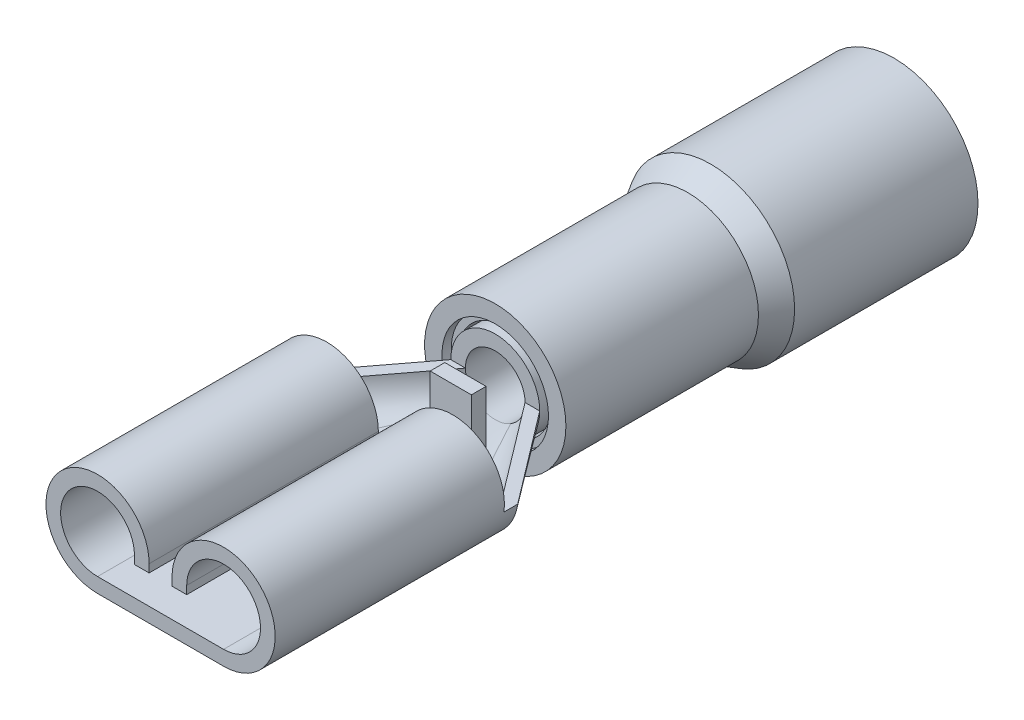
ISO-10303-21;
HEADER;
FILE_DESCRIPTION(('STEP AP214'),'2;1');
FILE_NAME('part.step','',(''),(''),'','','');
FILE_SCHEMA(('AUTOMOTIVE_DESIGN { 1 0 10303 214 1 1 1 1 }'));
ENDSEC;
DATA;
#1=APPLICATION_CONTEXT('core data for automotive mechanical design processes');
#2=APPLICATION_PROTOCOL_DEFINITION('international standard','automotive_design',2000,#1);
#3=PRODUCT_CONTEXT('',#1,'mechanical');
#4=PRODUCT('Part','Part','',(#3));
#5=PRODUCT_RELATED_PRODUCT_CATEGORY('part','',(#4));
#6=PRODUCT_DEFINITION_FORMATION('','',#4);
#7=PRODUCT_DEFINITION_CONTEXT('part definition',#1,'design');
#8=PRODUCT_DEFINITION('design','',#6,#7);
#9=PRODUCT_DEFINITION_SHAPE('','',#8);
#10=(LENGTH_UNIT() NAMED_UNIT(*) SI_UNIT(.MILLI.,.METRE.));
#11=(NAMED_UNIT(*) PLANE_ANGLE_UNIT() SI_UNIT($,.RADIAN.));
#12=(NAMED_UNIT(*) SI_UNIT($,.STERADIAN.) SOLID_ANGLE_UNIT());
#13=UNCERTAINTY_MEASURE_WITH_UNIT(LENGTH_MEASURE(1.E-05),#10,'distance_accuracy_value','');
#14=(GEOMETRIC_REPRESENTATION_CONTEXT(3) GLOBAL_UNCERTAINTY_ASSIGNED_CONTEXT((#13)) GLOBAL_UNIT_ASSIGNED_CONTEXT((#10,
#11,#12)) REPRESENTATION_CONTEXT('',''));
#15=CARTESIAN_POINT('',(0.,0.,0.));
#16=DIRECTION('',(0.,0.,1.));
#17=DIRECTION('',(1.,0.,0.));
#18=AXIS2_PLACEMENT_3D('',#15,#16,#17);
#19=CARTESIAN_POINT('',(0.,1.2319,-18.415));
#20=DIRECTION('',(0.,0.,1.));
#21=DIRECTION('',(1.,0.,0.));
#22=AXIS2_PLACEMENT_3D('',#19,#20,#21);
#23=PLANE('',#22);
#24=CARTESIAN_POINT('',(0.,1.2319,-18.415));
#25=DIRECTION('',(0.,0.,1.));
#26=DIRECTION('',(1.,0.,0.));
#27=AXIS2_PLACEMENT_3D('',#24,#25,#26);
#28=CIRCLE('',#27,1.8415);
#29=CARTESIAN_POINT('',(1.8415,1.2319,-18.415));
#30=VERTEX_POINT('',#29);
#31=EDGE_CURVE('E804',#30,#30,#28,.F.);
#32=ORIENTED_EDGE('',*,*,#31,.T.);
#33=EDGE_LOOP('',(#32));
#34=FACE_BOUND('',#33,.T.);
#35=ADVANCED_FACE('F15',(#34),#23,.F.);
#36=CARTESIAN_POINT('',(0.,1.2319,-20.87245));
#37=DIRECTION('',(0.,0.,1.));
#38=DIRECTION('',(1.,0.,0.));
#39=AXIS2_PLACEMENT_3D('',#36,#37,#38);
#40=CYLINDRICAL_SURFACE('',#39,1.8415);
#41=ORIENTED_EDGE('',*,*,#31,.F.);
#42=EDGE_LOOP('',(#41));
#43=FACE_BOUND('',#42,.T.);
#44=CARTESIAN_POINT('',(0.,1.2319,-20.32));
#45=DIRECTION('',(0.,0.,1.));
#46=DIRECTION('',(1.,0.,0.));
#47=AXIS2_PLACEMENT_3D('',#44,#45,#46);
#48=CIRCLE('',#47,1.8415);
#49=CARTESIAN_POINT('',(1.8415,1.2319,-20.32));
#50=VERTEX_POINT('',#49);
#51=EDGE_CURVE('E807',#50,#50,#48,.F.);
#52=ORIENTED_EDGE('',*,*,#51,.T.);
#53=EDGE_LOOP('',(#52));
#54=FACE_BOUND('',#53,.T.);
#55=ADVANCED_FACE('F1007',(#43,#54),#40,.F.);
#56=CARTESIAN_POINT('',(0.,1.2319,-20.32));
#57=DIRECTION('',(0.,0.,1.));
#58=DIRECTION('',(1.,0.,0.));
#59=AXIS2_PLACEMENT_3D('',#56,#57,#58);
#60=PLANE('',#59);
#61=ORIENTED_EDGE('',*,*,#51,.F.);
#62=EDGE_LOOP('',(#61));
#63=FACE_BOUND('',#62,.T.);
#64=CARTESIAN_POINT('',(0.,1.2319,-20.32));
#65=DIRECTION('',(0.,0.,1.));
#66=DIRECTION('',(1.,0.,0.));
#67=AXIS2_PLACEMENT_3D('',#64,#65,#66);
#68=CIRCLE('',#67,2.3241);
#69=CARTESIAN_POINT('',(2.3241,1.2319,-20.32));
#70=VERTEX_POINT('',#69);
#71=EDGE_CURVE('E640',#70,#70,#68,.T.);
#72=ORIENTED_EDGE('',*,*,#71,.F.);
#73=EDGE_LOOP('',(#72));
#74=FACE_BOUND('',#73,.T.);
#75=ADVANCED_FACE('F997',(#63,#74),#60,.F.);
#76=CARTESIAN_POINT('',(0.,1.2319,-20.87245));
#77=DIRECTION('',(0.,0.,1.));
#78=DIRECTION('',(1.,0.,0.));
#79=AXIS2_PLACEMENT_3D('',#76,#77,#78);
#80=CYLINDRICAL_SURFACE('',#79,2.3241);
#81=CARTESIAN_POINT('',(0.,1.2319,-15.2399999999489));
#82=DIRECTION('',(0.,0.,-1.));
#83=DIRECTION('',(0.,-1.,0.));
#84=AXIS2_PLACEMENT_3D('',#81,#82,#83);
#85=CIRCLE('',#84,2.32410000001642);
#86=CARTESIAN_POINT('',(0.,-1.09220000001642,-15.2399999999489));
#87=VERTEX_POINT('',#86);
#88=EDGE_CURVE('E638',#87,#87,#85,.F.);
#89=ORIENTED_EDGE('',*,*,#88,.F.);
#90=EDGE_LOOP('',(#89));
#91=FACE_BOUND('',#90,.T.);
#92=ORIENTED_EDGE('',*,*,#71,.T.);
#93=EDGE_LOOP('',(#92));
#94=FACE_BOUND('',#93,.T.);
#95=ADVANCED_FACE('F987',(#91,#94),#80,.T.);
#96=CARTESIAN_POINT('',(0.,1.2319,-15.239999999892));
#97=DIRECTION('',(0.,0.,-1.));
#98=DIRECTION('',(-1.,0.,0.));
#99=AXIS2_PLACEMENT_3D('',#96,#97,#98);
#100=CONICAL_SURFACE('',#99,2.32409999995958,0.523598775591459);
#101=CARTESIAN_POINT('',(0.,1.2319,-14.605));
#102=DIRECTION('',(0.,0.,1.));
#103=DIRECTION('',(1.,0.,0.));
#104=AXIS2_PLACEMENT_3D('',#101,#102,#103);
#105=CIRCLE('',#104,1.957482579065);
#106=CARTESIAN_POINT('',(1.957482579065,1.2319,-14.605));
#107=VERTEX_POINT('',#106);
#108=EDGE_CURVE('E629',#107,#107,#105,.T.);
#109=ORIENTED_EDGE('',*,*,#108,.F.);
#110=EDGE_LOOP('',(#109));
#111=FACE_BOUND('',#110,.T.);
#112=ORIENTED_EDGE('',*,*,#88,.T.);
#113=EDGE_LOOP('',(#112));
#114=FACE_BOUND('',#113,.T.);
#115=ADVANCED_FACE('F977',(#111,#114),#100,.T.);
#116=CARTESIAN_POINT('',(0.,1.2319,-20.87245));
#117=DIRECTION('',(0.,0.,1.));
#118=DIRECTION('',(1.,0.,0.));
#119=AXIS2_PLACEMENT_3D('',#116,#117,#118);
#120=CYLINDRICAL_SURFACE('',#119,1.957482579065);
#121=CARTESIAN_POINT('',(0.,1.2319,-9.271));
#122=DIRECTION('',(0.,0.,1.));
#123=DIRECTION('',(1.,0.,0.));
#124=AXIS2_PLACEMENT_3D('',#121,#122,#123);
#125=CIRCLE('',#124,1.957482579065);
#126=CARTESIAN_POINT('',(1.957482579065,1.2319,-9.271));
#127=VERTEX_POINT('',#126);
#128=EDGE_CURVE('E637',#127,#127,#125,.T.);
#129=ORIENTED_EDGE('',*,*,#128,.F.);
#130=EDGE_LOOP('',(#129));
#131=FACE_BOUND('',#130,.T.);
#132=ORIENTED_EDGE('',*,*,#108,.T.);
#133=EDGE_LOOP('',(#132));
#134=FACE_BOUND('',#133,.T.);
#135=ADVANCED_FACE('F967',(#131,#134),#120,.T.);
#136=CARTESIAN_POINT('',(0.,1.2319,-9.271));
#137=DIRECTION('',(0.,0.,1.));
#138=DIRECTION('',(1.,0.,0.));
#139=AXIS2_PLACEMENT_3D('',#136,#137,#138);
#140=PLANE('',#139);
#141=CARTESIAN_POINT('',(0.,1.2319,-9.271));
#142=DIRECTION('',(0.,0.,1.));
#143=DIRECTION('',(1.,0.,0.));
#144=AXIS2_PLACEMENT_3D('',#141,#142,#143);
#145=CIRCLE('',#144,1.474882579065);
#146=CARTESIAN_POINT('',(1.474882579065,1.2319,-9.271));
#147=VERTEX_POINT('',#146);
#148=EDGE_CURVE('E814',#147,#147,#145,.F.);
#149=ORIENTED_EDGE('',*,*,#148,.T.);
#150=EDGE_LOOP('',(#149));
#151=FACE_BOUND('',#150,.T.);
#152=ORIENTED_EDGE('',*,*,#128,.T.);
#153=EDGE_LOOP('',(#152));
#154=FACE_BOUND('',#153,.T.);
#155=ADVANCED_FACE('F957',(#151,#154),#140,.T.);
#156=CARTESIAN_POINT('',(0.,1.2319,-20.87245));
#157=DIRECTION('',(0.,0.,1.));
#158=DIRECTION('',(1.,0.,0.));
#159=AXIS2_PLACEMENT_3D('',#156,#157,#158);
#160=CYLINDRICAL_SURFACE('',#159,1.474882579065);
#161=ORIENTED_EDGE('',*,*,#148,.F.);
#162=EDGE_LOOP('',(#161));
#163=FACE_BOUND('',#162,.T.);
#164=CARTESIAN_POINT('',(0.,1.2319,-9.525));
#165=DIRECTION('',(0.,0.,1.));
#166=DIRECTION('',(1.,0.,0.));
#167=AXIS2_PLACEMENT_3D('',#164,#165,#166);
#168=CIRCLE('',#167,1.474882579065);
#169=CARTESIAN_POINT('',(1.474882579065,1.2319,-9.525));
#170=VERTEX_POINT('',#169);
#171=EDGE_CURVE('E817',#170,#170,#168,.T.);
#172=ORIENTED_EDGE('',*,*,#171,.F.);
#173=EDGE_LOOP('',(#172));
#174=FACE_BOUND('',#173,.T.);
#175=ADVANCED_FACE('F842',(#163,#174),#160,.F.);
#176=CARTESIAN_POINT('',(0.,1.2319,-9.525));
#177=DIRECTION('',(0.,0.,1.));
#178=DIRECTION('',(1.,0.,0.));
#179=AXIS2_PLACEMENT_3D('',#176,#177,#178);
#180=PLANE('',#179);
#181=CARTESIAN_POINT('',(0.,1.2319,-9.525));
#182=DIRECTION('',(0.,0.,1.));
#183=DIRECTION('',(1.,0.,0.));
#184=AXIS2_PLACEMENT_3D('',#181,#182,#183);
#185=CIRCLE('',#184,1.2827);
#186=CARTESIAN_POINT('',(1.2827,1.2319,-9.525));
#187=VERTEX_POINT('',#186);
#188=EDGE_CURVE('E820',#187,#187,#185,.F.);
#189=ORIENTED_EDGE('',*,*,#188,.T.);
#190=EDGE_LOOP('',(#189));
#191=FACE_BOUND('',#190,.T.);
#192=ORIENTED_EDGE('',*,*,#171,.T.);
#193=EDGE_LOOP('',(#192));
#194=FACE_BOUND('',#193,.T.);
#195=ADVANCED_FACE('F833',(#191,#194),#180,.T.);
#196=CARTESIAN_POINT('',(0.,1.2319,-20.87245));
#197=DIRECTION('',(0.,0.,1.));
#198=DIRECTION('',(1.,0.,0.));
#199=AXIS2_PLACEMENT_3D('',#196,#197,#198);
#200=CYLINDRICAL_SURFACE('',#199,1.2827);
#201=ORIENTED_EDGE('',*,*,#188,.F.);
#202=EDGE_LOOP('',(#201));
#203=FACE_BOUND('',#202,.T.);
#204=CARTESIAN_POINT('',(0.,1.2319,-14.605));
#205=DIRECTION('',(0.,0.,1.));
#206=DIRECTION('',(1.,0.,0.));
#207=AXIS2_PLACEMENT_3D('',#204,#205,#206);
#208=CIRCLE('',#207,1.2827);
#209=CARTESIAN_POINT('',(1.2827,1.2319,-14.605));
#210=VERTEX_POINT('',#209);
#211=EDGE_CURVE('E221',#210,#210,#208,.T.);
#212=ORIENTED_EDGE('',*,*,#211,.F.);
#213=EDGE_LOOP('',(#212));
#214=FACE_BOUND('',#213,.T.);
#215=ADVANCED_FACE('F831',(#203,#214),#200,.F.);
#216=CARTESIAN_POINT('',(0.,1.2319,-14.605));
#217=DIRECTION('',(0.,0.,1.));
#218=DIRECTION('',(1.,0.,0.));
#219=AXIS2_PLACEMENT_3D('',#216,#217,#218);
#220=PLANE('',#219);
#221=CARTESIAN_POINT('',(0.,1.2319,-14.605));
#222=DIRECTION('',(0.,0.,1.));
#223=DIRECTION('',(1.,0.,0.));
#224=AXIS2_PLACEMENT_3D('',#221,#222,#223);
#225=CIRCLE('',#224,1.2319);
#226=CARTESIAN_POINT('',(1.2319,1.2319,-14.605));
#227=VERTEX_POINT('',#226);
#228=EDGE_CURVE('E231',#227,#227,#225,.T.);
#229=ORIENTED_EDGE('',*,*,#228,.F.);
#230=EDGE_LOOP('',(#229));
#231=FACE_BOUND('',#230,.T.);
#232=ORIENTED_EDGE('',*,*,#211,.T.);
#233=EDGE_LOOP('',(#232));
#234=FACE_BOUND('',#233,.T.);
#235=ADVANCED_FACE('F254',(#231,#234),#220,.T.);
#236=CARTESIAN_POINT('',(0.,1.2319,-14.8717));
#237=DIRECTION('',(0.,0.,1.));
#238=DIRECTION('',(1.,0.,0.));
#239=AXIS2_PLACEMENT_3D('',#236,#237,#238);
#240=CYLINDRICAL_SURFACE('',#239,1.2319);
#241=CARTESIAN_POINT('',(0.0926090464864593,0.00348591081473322,-9.271084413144));
#242=CARTESIAN_POINT('',(0.08875762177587,0.00319555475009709,-9.27108089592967));
#243=CARTESIAN_POINT('',(0.0849048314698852,0.00292331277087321,-9.27107737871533));
#244=CARTESIAN_POINT('',(0.0771968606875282,0.00241507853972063,-9.27107034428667));
#245=CARTESIAN_POINT('',(0.073341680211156,0.00217908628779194,-9.27106682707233));
#246=CARTESIAN_POINT('',(0.0656292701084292,0.0017433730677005,-9.27105979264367));
#247=CARTESIAN_POINT('',(0.0617720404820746,0.00154365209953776,-9.27105627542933));
#248=CARTESIAN_POINT('',(0.0540558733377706,0.0011804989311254,-9.27104924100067));
#249=CARTESIAN_POINT('',(0.0501969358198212,0.0010170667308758,-9.27104572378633));
#250=CARTESIAN_POINT('',(0.0424776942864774,0.000726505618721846,-9.27103868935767));
#251=CARTESIAN_POINT('',(0.0386173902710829,0.000599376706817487,-9.27103517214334));
#252=CARTESIAN_POINT('',(0.0308957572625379,0.000381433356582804,-9.27102813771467));
#253=CARTESIAN_POINT('',(0.0270344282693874,0.000290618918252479,-9.27102462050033));
#254=CARTESIAN_POINT('',(0.0193110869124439,0.000145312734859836,-9.27101758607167));
#255=CARTESIAN_POINT('',(0.015449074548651,9.08209897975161E-05,-9.27101406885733));
#256=CARTESIAN_POINT('',(0.00772470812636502,1.81643339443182E-05,-9.27100703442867));
#257=CARTESIAN_POINT('',(0.00386235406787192,-5.76846560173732E-10,-9.27100351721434));
#258=CARTESIAN_POINT('',(0.,0.,-9.271));
#259=B_SPLINE_CURVE_WITH_KNOTS('',3,(#241,#242,#243,#244,#245,#246,#247,#248,#249,#250,#251,
#252,#253,#254,#255,#256,#257,#258),.UNSPECIFIED.,.F.,.F.,(4,2,2,2,2,2,2,2,4),(0.,
0.0115870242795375,0.0231740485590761,0.0347610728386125,0.0463480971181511,0.0579351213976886,
0.0695221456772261,0.0811091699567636,0.0926961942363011),.UNSPECIFIED.);
#260=CARTESIAN_POINT('',(0.0926090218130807,0.00348623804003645,-9.2710844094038));
#261=VERTEX_POINT('',#260);
#262=CARTESIAN_POINT('',(0.,0.,-9.271));
#263=VERTEX_POINT('',#262);
#264=EDGE_CURVE('E614',#261,#263,#259,.T.);
#265=ORIENTED_EDGE('',*,*,#264,.T.);
#266=CARTESIAN_POINT('',(0.,0.,-9.271));
#267=CARTESIAN_POINT('',(-0.00380102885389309,-5.4107472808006E-10,-9.27100758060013));
#268=CARTESIAN_POINT('',(-0.00760205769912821,1.75920989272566E-05,-9.27101516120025));
#269=CARTESIAN_POINT('',(-0.0152037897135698,8.79598568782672E-05,-9.2710303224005));
#270=CARTESIAN_POINT('',(-0.0190044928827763,0.000140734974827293,-9.27103790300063));
#271=CARTESIAN_POINT('',(-0.0266052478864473,0.000281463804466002,-9.27105306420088));
#272=CARTESIAN_POINT('',(-0.030405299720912,0.000369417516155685,-9.271060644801));
#273=CARTESIAN_POINT('',(-0.0380044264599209,0.000580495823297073,-9.27107580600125));
#274=CARTESIAN_POINT('',(-0.0418035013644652,0.000703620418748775,-9.27108338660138));
#275=CARTESIAN_POINT('',(-0.0494003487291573,0.000985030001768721,-9.27109854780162));
#276=CARTESIAN_POINT('',(-0.0531981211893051,0.00114331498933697,-9.27110612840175));
#277=CARTESIAN_POINT('',(-0.0607920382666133,0.00149503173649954,-9.271121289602));
#278=CARTESIAN_POINT('',(-0.0645881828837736,0.00168846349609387,-9.27112887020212));
#279=CARTESIAN_POINT('',(-0.0721785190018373,0.00211045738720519,-9.27114403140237));
#280=CARTESIAN_POINT('',(-0.0759727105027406,0.0023390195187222,-9.2711516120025));
#281=CARTESIAN_POINT('',(-0.083558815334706,0.00283125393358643,-9.27116677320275));
#282=CARTESIAN_POINT('',(-0.087350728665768,0.00309492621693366,-9.27117435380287));
#283=CARTESIAN_POINT('',(-0.0911413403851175,0.0033761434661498,-9.271181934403));
#284=B_SPLINE_CURVE_WITH_KNOTS('',3,(#266,#267,#268,#269,#270,#271,#272,#273,#274,#275,#276,
#277,#278,#279,#280,#281,#282,#283),.UNSPECIFIED.,.F.,.F.,(4,2,2,2,2,2,2,2,4),(0.,
0.0114030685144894,0.0228061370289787,0.0342092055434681,0.0456122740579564,0.0570153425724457,
0.068418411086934,0.0798214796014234,0.0912245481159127),.UNSPECIFIED.);
#285=CARTESIAN_POINT('',(-0.0911414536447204,0.00337683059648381,-9.27118193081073));
#286=VERTEX_POINT('',#285);
#287=EDGE_CURVE('E616',#263,#286,#284,.T.);
#288=ORIENTED_EDGE('',*,*,#287,.T.);
#289=CARTESIAN_POINT('',(-0.426538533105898,0.0762000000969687,-9.27099999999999));
#290=CARTESIAN_POINT('',(-0.413422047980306,0.0713582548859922,-9.27100589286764));
#291=CARTESIAN_POINT('',(-0.400223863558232,0.0667368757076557,-9.27101195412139));
#292=CARTESIAN_POINT('',(-0.374390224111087,0.0581840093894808,-9.27102409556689));
#293=CARTESIAN_POINT('',(-0.361762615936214,0.0542288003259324,-9.27103015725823));
#294=CARTESIAN_POINT('',(-0.337023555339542,0.0469247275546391,-9.27104229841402));
#295=CARTESIAN_POINT('',(-0.324918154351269,0.0435553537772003,-9.27104836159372));
#296=CARTESIAN_POINT('',(-0.301179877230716,0.0373312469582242,-9.27106050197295));
#297=CARTESIAN_POINT('',(-0.289551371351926,0.0344598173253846,-9.27106656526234));
#298=CARTESIAN_POINT('',(-0.266722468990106,0.0291713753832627,-9.27107870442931));
#299=CARTESIAN_POINT('',(-0.255525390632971,0.0267400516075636,-9.27108476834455));
#300=CARTESIAN_POINT('',(-0.233516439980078,0.0222862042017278,-9.27109690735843));
#301=CARTESIAN_POINT('',(-0.222707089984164,0.0202512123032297,-9.27110297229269));
#302=CARTESIAN_POINT('',(-0.20143170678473,0.0165389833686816,-9.27111511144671));
#303=CARTESIAN_POINT('',(-0.190967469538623,0.0148514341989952,-9.27112117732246));
#304=CARTESIAN_POINT('',(-0.170337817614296,0.0117933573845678,-9.2711333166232));
#305=CARTESIAN_POINT('',(-0.160173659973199,0.0104143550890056,-9.27113938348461));
#306=CARTESIAN_POINT('',(-0.140096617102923,0.00794912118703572,-9.27115152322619));
#307=CARTESIAN_POINT('',(-0.130184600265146,0.0068558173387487,-9.27115759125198));
#308=CARTESIAN_POINT('',(-0.110564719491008,0.0049332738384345,-9.27116973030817));
#309=CARTESIAN_POINT('',(-0.100857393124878,0.00409854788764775,-9.27117579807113));
#310=CARTESIAN_POINT('',(-0.0911416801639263,0.00337820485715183,-9.27118192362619));
#311=B_SPLINE_CURVE_WITH_KNOTS('',3,(#289,#290,#291,#292,#293,#294,#295,#296,#297,#298,#299,
#300,#301,#302,#303,#304,#305,#306,#307,#308,#309,#310),.UNSPECIFIED.,.F.,.F.,(4,2,2,2,2,2,2,2,
2,2,4),(0.,0.0419432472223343,0.0816338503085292,0.119324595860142,0.155253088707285,
0.189622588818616,0.222616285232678,0.254411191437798,0.285179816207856,0.315093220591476,
0.3443198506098),.UNSPECIFIED.);
#312=CARTESIAN_POINT('',(-0.426538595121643,0.0761998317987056,-9.27099913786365));
#313=VERTEX_POINT('',#312);
#314=EDGE_CURVE('E612',#286,#313,#311,.F.);
#315=ORIENTED_EDGE('',*,*,#314,.T.);
#316=CARTESIAN_POINT('',(-0.426538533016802,0.0762000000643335,-9.27100000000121));
#317=CARTESIAN_POINT('',(-0.486078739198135,0.0981334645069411,-9.27099369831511));
#318=CARTESIAN_POINT('',(-0.543877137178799,0.124730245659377,-9.27099060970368));
#319=CARTESIAN_POINT('',(-0.65472023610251,0.18647253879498,-9.27098725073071));
#320=CARTESIAN_POINT('',(-0.707764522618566,0.221618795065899,-9.27098698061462));
#321=CARTESIAN_POINT('',(-0.812399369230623,0.303251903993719,-9.27098558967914));
#322=CARTESIAN_POINT('',(-0.863412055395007,0.350482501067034,-9.27098439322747));
#323=CARTESIAN_POINT('',(-0.956779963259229,0.452832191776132,-9.27098346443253));
#324=CARTESIAN_POINT('',(-0.999135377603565,0.507951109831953,-9.27098373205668));
#325=CARTESIAN_POINT('',(-1.0739978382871,0.624522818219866,-9.27098485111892));
#326=CARTESIAN_POINT('',(-1.10650325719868,0.685976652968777,-9.27098570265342));
#327=CARTESIAN_POINT('',(-1.16072769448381,0.81347161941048,-9.27098539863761));
#328=CARTESIAN_POINT('',(-1.18245003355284,0.879511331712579,-9.27098424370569));
#329=CARTESIAN_POINT('',(-1.20957597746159,0.993551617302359,-9.27098835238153));
#330=CARTESIAN_POINT('',(-1.21794164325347,1.04086966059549,-9.27099175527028));
#331=CARTESIAN_POINT('',(-1.22910361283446,1.13608552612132,-9.2709976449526));
#332=CARTESIAN_POINT('',(-1.23190829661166,1.18398236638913,-9.27100013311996));
#333=CARTESIAN_POINT('',(-1.2319,1.23190001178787,-9.27100000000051));
#334=B_SPLINE_CURVE_WITH_KNOTS('',3,(#316,#317,#318,#319,#320,#321,#322,#323,#324,#325,#326,
#327,#328,#329,#330,#331,#332,#333),.UNSPECIFIED.,.F.,.F.,(4,2,2,2,2,2,2,2,4),(0.,
0.190130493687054,0.380277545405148,0.587835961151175,0.795389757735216,1.00297782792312,
1.21050193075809,1.35434962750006,1.4979803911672),.UNSPECIFIED.);
#335=CARTESIAN_POINT('',(-1.23190000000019,1.23190001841,-9.271));
#336=VERTEX_POINT('',#335);
#337=EDGE_CURVE('E197',#313,#336,#334,.T.);
#338=ORIENTED_EDGE('',*,*,#337,.T.);
#339=CARTESIAN_POINT('',(0.,1.2319,-9.271));
#340=DIRECTION('',(0.,0.,1.));
#341=DIRECTION('',(1.,0.,0.));
#342=AXIS2_PLACEMENT_3D('',#339,#340,#341);
#343=CIRCLE('',#342,1.2319);
#344=CARTESIAN_POINT('',(1.2319000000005,1.23189999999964,-9.27100000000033));
#345=VERTEX_POINT('',#344);
#346=EDGE_CURVE('E201',#345,#336,#343,.T.);
#347=ORIENTED_EDGE('',*,*,#346,.F.);
#348=CARTESIAN_POINT('',(1.2319,1.2318999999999,-9.27100000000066));
#349=CARTESIAN_POINT('',(1.23190008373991,1.20001844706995,-9.27098921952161));
#350=CARTESIAN_POINT('',(1.23066178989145,1.1681491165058,-9.27098779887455));
#351=CARTESIAN_POINT('',(1.22572010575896,1.10460528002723,-9.27099177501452));
#352=CARTESIAN_POINT('',(1.22201695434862,1.07293075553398,-9.27099717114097));
#353=CARTESIAN_POINT('',(1.20723379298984,0.97848686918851,-9.27100573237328));
#354=CARTESIAN_POINT('',(1.19248004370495,0.91625500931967,-9.27100128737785));
#355=CARTESIAN_POINT('',(1.15183997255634,0.789583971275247,-9.27099788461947));
#356=CARTESIAN_POINT('',(1.12510178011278,0.725418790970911,-9.27099943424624));
#357=CARTESIAN_POINT('',(1.06123175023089,0.602486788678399,-9.27100042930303));
#358=CARTESIAN_POINT('',(1.02410019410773,0.543719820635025,-9.27099987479));
#359=CARTESIAN_POINT('',(0.940496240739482,0.433247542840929,-9.27100009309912));
#360=CARTESIAN_POINT('',(0.894022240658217,0.381543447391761,-9.2710008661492));
#361=CARTESIAN_POINT('',(0.793048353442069,0.286677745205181,-9.27099706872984));
#362=CARTESIAN_POINT('',(0.738551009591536,0.24351344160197,-9.27099249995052));
#363=CARTESIAN_POINT('',(0.641113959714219,0.17889095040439,-9.270994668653));
#364=CARTESIAN_POINT('',(0.599855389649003,0.154858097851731,-9.2709983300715));
#365=CARTESIAN_POINT('',(0.5149018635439,0.111755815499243,-9.27100309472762));
#366=CARTESIAN_POINT('',(0.471210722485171,0.0926788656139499,-9.27100420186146));
#367=CARTESIAN_POINT('',(0.426538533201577,0.0762000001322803,-9.27100000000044));
#368=B_SPLINE_CURVE_WITH_KNOTS('',3,(#348,#349,#350,#351,#352,#353,#354,#355,#356,#357,#358,
#359,#360,#361,#362,#363,#364,#365,#366,#367),.UNSPECIFIED.,.F.,.F.,(4,2,2,2,2,2,2,2,2,4),(0.,
0.0955963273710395,0.191183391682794,0.382232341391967,0.58979131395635,0.797344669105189,
1.0049336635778,1.21245699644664,1.3553985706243,1.49812196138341),.UNSPECIFIED.);
#369=CARTESIAN_POINT('',(0.426535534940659,0.0762081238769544,-9.27108311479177));
#370=VERTEX_POINT('',#369);
#371=EDGE_CURVE('E206',#345,#370,#368,.T.);
#372=ORIENTED_EDGE('',*,*,#371,.T.);
#373=CARTESIAN_POINT('',(-0.43895708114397,0.0808766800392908,-9.27108440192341));
#374=CARTESIAN_POINT('',(-0.434773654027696,0.0792828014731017,-9.27108440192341));
#375=CARTESIAN_POINT('',(-0.385733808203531,0.0608936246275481,-9.27108440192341));
#376=CARTESIAN_POINT('',(-0.299507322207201,0.0350245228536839,-9.27108440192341));
#377=CARTESIAN_POINT('',(-0.190972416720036,0.013427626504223,-9.27108440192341));
#378=CARTESIAN_POINT('',(-0.0928553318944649,0.00228712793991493,-9.27108440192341));
#379=CARTESIAN_POINT('',(0.,-0.00114356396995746,-9.27108440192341));
#380=CARTESIAN_POINT('',(0.0928553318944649,0.00228712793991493,-9.27108440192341));
#381=CARTESIAN_POINT('',(0.190972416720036,0.013427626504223,-9.27108440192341));
#382=CARTESIAN_POINT('',(0.299507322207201,0.0350245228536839,-9.27108440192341));
#383=CARTESIAN_POINT('',(0.385667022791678,0.0608735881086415,-9.27108440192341));
#384=CARTESIAN_POINT('',(0.434628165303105,0.0792282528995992,-9.27108440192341));
#385=CARTESIAN_POINT('',(0.438737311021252,0.0807929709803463,-9.27108440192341));
#386=B_SPLINE_CURVE_WITH_KNOTS('',3,(#373,#374,#375,#376,#377,#378,#379,#380,#381,#382,#383,
#384,#385),.UNSPECIFIED.,.F.,.F.,(4,1,1,1,1,1,1,1,1,1,4),(-0.01136536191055,
0.000202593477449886,0.12520259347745,0.25020259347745,0.37520259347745,0.50020259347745,
0.62520259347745,0.75020259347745,0.87520259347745,1.00020259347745,1.011567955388),.UNSPECIFIED.);
#387=EDGE_CURVE('E220',#370,#261,#386,.F.);
#388=ORIENTED_EDGE('',*,*,#387,.T.);
#389=EDGE_LOOP('',(#265,#288,#315,#338,#347,#372,#388));
#390=FACE_BOUND('',#389,.T.);
#391=ORIENTED_EDGE('',*,*,#228,.T.);
#392=EDGE_LOOP('',(#391));
#393=FACE_BOUND('',#392,.T.);
#394=ADVANCED_FACE('F203',(#390,#393),#240,.T.);
#395=CARTESIAN_POINT('',(0.,1.2319,-9.271));
#396=DIRECTION('',(0.,0.,1.));
#397=DIRECTION('',(1.,0.,0.));
#398=AXIS2_PLACEMENT_3D('',#395,#396,#397);
#399=PLANE('',#398);
#400=DIRECTION('',(1.,0.,0.));
#401=VECTOR('',#400,1.);
#402=CARTESIAN_POINT('',(0.,1.23190003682,-9.271));
#403=LINE('',#402,#401);
#404=CARTESIAN_POINT('',(-0.8255,1.23190001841,-9.271));
#405=VERTEX_POINT('',#404);
#406=EDGE_CURVE('E210',#336,#405,#403,.T.);
#407=ORIENTED_EDGE('',*,*,#406,.T.);
#408=CARTESIAN_POINT('',(0.,1.2319,-9.271));
#409=DIRECTION('',(0.,0.,1.));
#410=DIRECTION('',(1.,0.,0.));
#411=AXIS2_PLACEMENT_3D('',#408,#409,#410);
#412=CIRCLE('',#411,0.8255);
#413=CARTESIAN_POINT('',(0.8255,1.2319,-9.271));
#414=VERTEX_POINT('',#413);
#415=EDGE_CURVE('E229',#405,#414,#412,.F.);
#416=ORIENTED_EDGE('',*,*,#415,.T.);
#417=DIRECTION('',(1.,0.,0.));
#418=VECTOR('',#417,1.);
#419=CARTESIAN_POINT('',(0.,1.2319,-9.271));
#420=LINE('',#419,#418);
#421=EDGE_CURVE('E211',#414,#345,#420,.T.);
#422=ORIENTED_EDGE('',*,*,#421,.T.);
#423=ORIENTED_EDGE('',*,*,#346,.T.);
#424=EDGE_LOOP('',(#407,#416,#422,#423));
#425=FACE_BOUND('',#424,.T.);
#426=ADVANCED_FACE('F228',(#425),#399,.T.);
#427=CARTESIAN_POINT('',(0.,1.2319,-14.605));
#428=DIRECTION('',(0.,0.,1.));
#429=DIRECTION('',(1.,0.,0.));
#430=AXIS2_PLACEMENT_3D('',#427,#428,#429);
#431=PLANE('',#430);
#432=CARTESIAN_POINT('',(0.,1.2319,-14.605));
#433=DIRECTION('',(0.,0.,1.));
#434=DIRECTION('',(1.,0.,0.));
#435=AXIS2_PLACEMENT_3D('',#432,#433,#434);
#436=CIRCLE('',#435,0.8255);
#437=CARTESIAN_POINT('',(0.8255,1.2319,-14.605));
#438=VERTEX_POINT('',#437);
#439=EDGE_CURVE('E403',#438,#438,#436,.T.);
#440=ORIENTED_EDGE('',*,*,#439,.T.);
#441=EDGE_LOOP('',(#440));
#442=FACE_BOUND('',#441,.T.);
#443=ADVANCED_FACE('F417',(#442),#431,.T.);
#444=CARTESIAN_POINT('',(0.,1.2319,-14.8717));
#445=DIRECTION('',(0.,0.,1.));
#446=DIRECTION('',(1.,0.,0.));
#447=AXIS2_PLACEMENT_3D('',#444,#445,#446);
#448=CYLINDRICAL_SURFACE('',#447,0.8255);
#449=CARTESIAN_POINT('',(0.,0.4064,-9.271));
#450=CARTESIAN_POINT('',(-0.00403358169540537,0.406399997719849,-9.27100647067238));
#451=CARTESIAN_POINT('',(-0.00806716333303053,0.40642956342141,-9.27101294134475));
#452=CARTESIAN_POINT('',(-0.0161334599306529,0.406547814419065,-9.2710258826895));
#453=CARTESIAN_POINT('',(-0.02016617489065,0.40663649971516,-9.27103235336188));
#454=CARTESIAN_POINT('',(-0.028229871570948,0.406872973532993,-9.27104529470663));
#455=CARTESIAN_POINT('',(-0.0322608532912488,0.407020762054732,-9.271051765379));
#456=CARTESIAN_POINT('',(-0.0403202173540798,0.407375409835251,-9.27106470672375));
#457=CARTESIAN_POINT('',(-0.0443485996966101,0.407582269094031,-9.27107117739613));
#458=CARTESIAN_POINT('',(-0.0524018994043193,0.408055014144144,-9.27108411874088));
#459=CARTESIAN_POINT('',(-0.0564268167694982,0.408320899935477,-9.27109058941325));
#460=CARTESIAN_POINT('',(-0.0644723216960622,0.408911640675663,-9.271103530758));
#461=CARTESIAN_POINT('',(-0.0684929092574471,0.409236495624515,-9.27111000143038));
#462=CARTESIAN_POINT('',(-0.0765288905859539,0.409945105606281,-9.27112294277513));
#463=CARTESIAN_POINT('',(-0.0805442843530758,0.410328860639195,-9.2711294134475));
#464=CARTESIAN_POINT('',(-0.0885690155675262,0.411155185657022,-9.27114235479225));
#465=CARTESIAN_POINT('',(-0.0925783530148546,0.411597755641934,-9.27114882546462));
#466=CARTESIAN_POINT('',(-0.0965842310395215,0.412069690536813,-9.271155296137));
#467=B_SPLINE_CURVE_WITH_KNOTS('',3,(#449,#450,#451,#452,#453,#454,#455,#456,#457,#458,#459,
#460,#461,#462,#463,#464,#465,#466),.UNSPECIFIED.,.F.,.F.,(4,2,2,2,2,2,2,2,4),(0.,
0.0121006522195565,0.0242013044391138,0.0363019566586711,0.0484026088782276,0.0605032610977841,
0.0726039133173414,0.0847045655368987,0.0968052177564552),.UNSPECIFIED.);
#468=CARTESIAN_POINT('',(0.,0.4064,-9.271));
#469=VERTEX_POINT('',#468);
#470=CARTESIAN_POINT('',(-0.0965841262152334,0.412070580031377,-9.27115528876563));
#471=VERTEX_POINT('',#470);
#472=EDGE_CURVE('E498',#469,#471,#467,.T.);
#473=ORIENTED_EDGE('',*,*,#472,.F.);
#474=CARTESIAN_POINT('',(0.0963140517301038,0.412037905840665,-9.27104945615));
#475=CARTESIAN_POINT('',(0.0923192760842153,0.411568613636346,-9.27104739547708));
#476=CARTESIAN_POINT('',(0.0883210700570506,0.411128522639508,-9.27104533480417));
#477=CARTESIAN_POINT('',(0.0803186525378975,0.410306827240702,-9.27104121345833));
#478=CARTESIAN_POINT('',(0.0763144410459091,0.409925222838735,-9.27103915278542));
#479=CARTESIAN_POINT('',(0.0683008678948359,0.40922058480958,-9.27103503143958));
#480=CARTESIAN_POINT('',(0.0642915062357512,0.408897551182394,-9.27103297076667));
#481=CARTESIAN_POINT('',(0.0562684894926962,0.408310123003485,-9.27102884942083));
#482=CARTESIAN_POINT('',(0.052254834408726,0.408045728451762,-9.27102678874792));
#483=CARTESIAN_POINT('',(0.0442240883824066,0.407575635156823,-9.27102266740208));
#484=CARTESIAN_POINT('',(0.0402069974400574,0.407369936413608,-9.27102060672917));
#485=CARTESIAN_POINT('',(0.0321702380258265,0.407017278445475,-9.27101648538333));
#486=CARTESIAN_POINT('',(0.0281505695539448,0.406870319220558,-9.27101442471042));
#487=CARTESIAN_POINT('',(0.0201095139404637,0.406635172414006,-9.27101030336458));
#488=CARTESIAN_POINT('',(0.0160881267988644,0.406546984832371,-9.27100824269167));
#489=CARTESIAN_POINT('',(0.00804449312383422,0.406429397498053,-9.27100412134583));
#490=CARTESIAN_POINT('',(0.00402224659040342,0.40639999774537,-9.27100206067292));
#491=CARTESIAN_POINT('',(0.,0.4064,-9.271));
#492=B_SPLINE_CURVE_WITH_KNOTS('',3,(#474,#475,#476,#477,#478,#479,#480,#481,#482,#483,#484,
#485,#486,#487,#488,#489,#490,#491),.UNSPECIFIED.,.F.,.F.,(4,2,2,2,2,2,2,2,4),(0.,
0.0120666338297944,0.024133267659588,0.0361999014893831,0.0482665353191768,0.0603331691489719,
0.0723998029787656,0.0844664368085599,0.0965330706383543),.UNSPECIFIED.);
#493=CARTESIAN_POINT('',(0.0963140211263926,0.412038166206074,-9.27104802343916));
#494=VERTEX_POINT('',#493);
#495=EDGE_CURVE('E401',#494,#469,#492,.T.);
#496=ORIENTED_EDGE('',*,*,#495,.F.);
#497=CARTESIAN_POINT('',(0.437833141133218,0.532090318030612,-9.27104515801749));
#498=CARTESIAN_POINT('',(0.43404842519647,0.529724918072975,-9.27104515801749));
#499=CARTESIAN_POINT('',(0.39056477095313,0.503020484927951,-9.27104515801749));
#500=CARTESIAN_POINT('',(0.31039890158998,0.463898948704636,-9.27104515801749));
#501=CARTESIAN_POINT('',(0.202377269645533,0.429168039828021,-9.27104515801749));
#502=CARTESIAN_POINT('',(0.099749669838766,0.41036601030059,-9.27104515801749));
#503=CARTESIAN_POINT('',(0.,0.404416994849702,-9.27104515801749));
#504=CARTESIAN_POINT('',(-0.099749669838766,0.41036601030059,-9.27104515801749));
#505=CARTESIAN_POINT('',(-0.202377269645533,0.429168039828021,-9.27104515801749));
#506=CARTESIAN_POINT('',(-0.31039890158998,0.463898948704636,-9.27104515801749));
#507=CARTESIAN_POINT('',(-0.390508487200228,0.502993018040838,-9.27104515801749));
#508=CARTESIAN_POINT('',(-0.433931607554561,0.529653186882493,-9.27104515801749));
#509=CARTESIAN_POINT('',(-0.437657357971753,0.531980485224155,-9.27104515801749));
#510=B_SPLINE_CURVE_WITH_KNOTS('',3,(#497,#498,#499,#500,#501,#502,#503,#504,#505,#506,#507,
#508,#509),.UNSPECIFIED.,.F.,.F.,(4,1,1,1,1,1,1,1,1,1,4),(-0.0116914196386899,
0.00018386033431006,0.12518386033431,0.25018386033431,0.37518386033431,0.50018386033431,
0.62518386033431,0.75018386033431,0.87518386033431,1.00018386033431,1.011875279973),.UNSPECIFIED.);
#511=CARTESIAN_POINT('',(0.426534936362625,0.525142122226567,-9.27104730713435));
#512=VERTEX_POINT('',#511);
#513=EDGE_CURVE('E404',#512,#494,#510,.T.);
#514=ORIENTED_EDGE('',*,*,#513,.F.);
#515=CARTESIAN_POINT('',(0.8255,1.2319,-9.27100000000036));
#516=CARTESIAN_POINT('',(0.825501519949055,1.21132959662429,-9.27098996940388));
#517=CARTESIAN_POINT('',(0.824731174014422,1.19075945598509,-9.27096992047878));
#518=CARTESIAN_POINT('',(0.821658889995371,1.14974918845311,-9.27093880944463));
#519=CARTESIAN_POINT('',(0.819358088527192,1.12930897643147,-9.27092774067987));
#520=CARTESIAN_POINT('',(0.813236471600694,1.08865367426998,-9.27094351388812));
#521=CARTESIAN_POINT('',(0.809415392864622,1.06843862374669,-9.27097036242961));
#522=CARTESIAN_POINT('',(0.800274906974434,1.02834892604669,-9.27099777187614));
#523=CARTESIAN_POINT('',(0.794955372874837,1.00847430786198,-9.27099833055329));
#524=CARTESIAN_POINT('',(0.782069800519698,0.96665449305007,-9.27096223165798));
#525=CARTESIAN_POINT('',(0.774303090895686,0.944770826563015,-9.27092078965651));
#526=CARTESIAN_POINT('',(0.756953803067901,0.901734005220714,-9.27089520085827));
#527=CARTESIAN_POINT('',(0.747371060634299,0.880580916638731,-9.2709110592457));
#528=CARTESIAN_POINT('',(0.726451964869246,0.83914469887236,-9.27096518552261));
#529=CARTESIAN_POINT('',(0.715114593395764,0.818862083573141,-9.27100346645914));
#530=CARTESIAN_POINT('',(0.690771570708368,0.77932536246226,-9.27099383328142));
#531=CARTESIAN_POINT('',(0.677765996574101,0.760071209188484,-9.27094592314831));
#532=CARTESIAN_POINT('',(0.650168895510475,0.722714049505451,-9.27089219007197));
#533=CARTESIAN_POINT('',(0.635576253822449,0.704611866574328,-9.27088639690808));
#534=CARTESIAN_POINT('',(0.604914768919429,0.669700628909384,-9.27093747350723));
#535=CARTESIAN_POINT('',(0.58884576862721,0.652891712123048,-9.2709943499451));
#536=CARTESIAN_POINT('',(0.55538356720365,0.620723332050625,-9.27101151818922));
#537=CARTESIAN_POINT('',(0.537993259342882,0.605360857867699,-9.2709720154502));
#538=CARTESIAN_POINT('',(0.501980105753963,0.576153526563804,-9.27093583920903));
#539=CARTESIAN_POINT('',(0.483357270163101,0.562308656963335,-9.27093916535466));
#540=CARTESIAN_POINT('',(0.451858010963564,0.540888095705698,-9.27096566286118));
#541=CARTESIAN_POINT('',(0.439302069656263,0.53283809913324,-9.27098133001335));
#542=CARTESIAN_POINT('',(0.4265385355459,0.525136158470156,-9.27100000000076));
#543=B_SPLINE_CURVE_WITH_KNOTS('',3,(#515,#516,#517,#518,#519,#520,#521,#522,#523,#524,#525,
#526,#527,#528,#529,#530,#531,#532,#533,#534,#535,#536,#537,#538,#539,#540,#541,#542),
.UNSPECIFIED.,.F.,.F.,(4,2,2,2,2,2,2,2,2,2,2,2,2,4),(0.,0.061696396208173,0.123347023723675,
0.185008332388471,0.246674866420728,0.316253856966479,0.385839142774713,0.455464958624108,
0.525087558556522,0.594759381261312,0.664438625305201,0.733969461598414,0.803499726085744,
0.848221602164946),.UNSPECIFIED.);
#544=EDGE_CURVE('E425',#414,#512,#543,.T.);
#545=ORIENTED_EDGE('',*,*,#544,.F.);
#546=ORIENTED_EDGE('',*,*,#415,.F.);
#547=CARTESIAN_POINT('',(-0.426538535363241,0.525136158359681,-9.2710000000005));
#548=CARTESIAN_POINT('',(-0.444306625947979,0.535857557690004,-9.27096313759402));
#549=CARTESIAN_POINT('',(-0.461668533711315,0.54725137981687,-9.27094468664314));
#550=CARTESIAN_POINT('',(-0.495483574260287,0.571312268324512,-9.27093572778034));
#551=CARTESIAN_POINT('',(-0.511936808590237,0.583979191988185,-9.27094521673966));
#552=CARTESIAN_POINT('',(-0.543838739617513,0.610514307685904,-9.2709832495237));
#553=CARTESIAN_POINT('',(-0.559287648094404,0.624382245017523,-9.27101178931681));
#554=CARTESIAN_POINT('',(-0.589097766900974,0.653242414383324,-9.27099133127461));
#555=CARTESIAN_POINT('',(-0.603458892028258,0.66823473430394,-9.27094232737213));
#556=CARTESIAN_POINT('',(-0.632640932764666,0.701095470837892,-9.27088861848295));
#557=CARTESIAN_POINT('',(-0.647315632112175,0.719094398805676,-9.27088983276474));
#558=CARTESIAN_POINT('',(-0.675094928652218,0.756256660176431,-9.27093838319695));
#559=CARTESIAN_POINT('',(-0.688199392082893,0.775420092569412,-9.2709857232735));
#560=CARTESIAN_POINT('',(-0.725030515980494,0.834498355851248,-9.27101739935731));
#561=CARTESIAN_POINT('',(-0.746285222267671,0.876012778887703,-9.27089149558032));
#562=CARTESIAN_POINT('',(-0.77269422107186,0.940459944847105,-9.27091312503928));
#563=CARTESIAN_POINT('',(-0.780589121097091,0.962323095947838,-9.27095553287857));
#564=CARTESIAN_POINT('',(-0.794512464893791,1.00664764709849,-9.27099708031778));
#565=CARTESIAN_POINT('',(-0.80054070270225,1.02910911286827,-9.27099621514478));
#566=CARTESIAN_POINT('',(-0.810670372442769,1.07441339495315,-9.27096579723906));
#567=CARTESIAN_POINT('',(-0.814775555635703,1.09725537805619,-9.27093630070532));
#568=CARTESIAN_POINT('',(-0.821047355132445,1.14319645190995,-9.27092953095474));
#569=CARTESIAN_POINT('',(-0.823214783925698,1.16629543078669,-9.27095223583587));
#570=CARTESIAN_POINT('',(-0.825136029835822,1.20358328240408,-9.27098472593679));
#571=CARTESIAN_POINT('',(-0.825500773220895,1.21774271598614,-9.270996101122));
#572=CARTESIAN_POINT('',(-0.825500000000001,1.23190000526,-9.27100000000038));
#573=B_SPLINE_CURVE_WITH_KNOTS('',3,(#547,#548,#549,#550,#551,#552,#553,#554,#555,#556,#557,
#558,#559,#560,#561,#562,#563,#564,#565,#566,#567,#568,#569,#570,#571,#572),.UNSPECIFIED.,.F.,
.F.,(4,2,2,2,2,2,2,2,2,2,2,2,4),(0.,0.0622412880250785,0.124475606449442,0.186696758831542,
0.248922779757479,0.318502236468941,0.388087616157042,0.527212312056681,0.596885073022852,
0.666565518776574,0.736109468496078,0.805624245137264,0.848096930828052),.UNSPECIFIED.);
#574=CARTESIAN_POINT('',(-0.426542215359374,0.525130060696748,-9.27095162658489));
#575=VERTEX_POINT('',#574);
#576=EDGE_CURVE('E377',#575,#405,#573,.T.);
#577=ORIENTED_EDGE('',*,*,#576,.F.);
#578=CARTESIAN_POINT('',(-0.0965839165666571,0.412072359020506,-9.27115527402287));
#579=CARTESIAN_POINT('',(-0.109485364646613,0.413589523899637,-9.2711468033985));
#580=CARTESIAN_POINT('',(-0.122350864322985,0.415412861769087,-9.2711384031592));
#581=CARTESIAN_POINT('',(-0.148264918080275,0.419713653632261,-9.27112159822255));
#582=CARTESIAN_POINT('',(-0.161311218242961,0.4222046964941,-9.27111319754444));
#583=CARTESIAN_POINT('',(-0.187633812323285,0.427894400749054,-9.27109639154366));
#584=CARTESIAN_POINT('',(-0.200906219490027,0.431111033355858,-9.27108799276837));
#585=CARTESIAN_POINT('',(-0.227723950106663,0.438312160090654,-9.27107118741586));
#586=CARTESIAN_POINT('',(-0.241263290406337,0.442318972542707,-9.27106279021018));
#587=CARTESIAN_POINT('',(-0.268641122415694,0.451199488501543,-9.27104598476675));
#588=CARTESIAN_POINT('',(-0.282470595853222,0.45610097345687,-9.27103758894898));
#589=CARTESIAN_POINT('',(-0.310462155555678,0.466856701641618,-9.27102078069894));
#590=CARTESIAN_POINT('',(-0.324611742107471,0.472743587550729,-9.27101238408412));
#591=CARTESIAN_POINT('',(-0.345829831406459,0.482273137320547,-9.2709999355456));
#592=CARTESIAN_POINT('',(-0.353027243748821,0.485631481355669,-9.27099573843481));
#593=CARTESIAN_POINT('',(-0.367512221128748,0.492650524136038,-9.27098734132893));
#594=CARTESIAN_POINT('',(-0.374797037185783,0.496316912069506,-9.27098314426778));
#595=CARTESIAN_POINT('',(-0.389459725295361,0.503973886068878,-9.27097474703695));
#596=CARTESIAN_POINT('',(-0.39683432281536,0.507970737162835,-9.27097055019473));
#597=CARTESIAN_POINT('',(-0.411680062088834,0.51631055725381,-9.27096215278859));
#598=CARTESIAN_POINT('',(-0.419147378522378,0.520660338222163,-9.27095795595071));
#599=CARTESIAN_POINT('',(-0.426545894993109,0.525123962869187,-9.2709538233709));
#600=B_SPLINE_CURVE_WITH_KNOTS('',3,(#578,#579,#580,#581,#582,#583,#584,#585,#586,#587,#588,
#589,#590,#591,#592,#593,#594,#595,#596,#597,#598,#599),.UNSPECIFIED.,.F.,.F.,(4,2,2,2,2,2,2,2,
2,2,4),(0.,0.0389675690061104,0.0787979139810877,0.119751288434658,0.162091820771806,
0.20608876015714,0.252039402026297,0.275863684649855,0.300326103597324,0.325486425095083,
0.351407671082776),.UNSPECIFIED.);
#601=EDGE_CURVE('E395',#471,#575,#600,.T.);
#602=ORIENTED_EDGE('',*,*,#601,.F.);
#603=EDGE_LOOP('',(#473,#496,#514,#545,#546,#577,#602));
#604=FACE_BOUND('',#603,.T.);
#605=ORIENTED_EDGE('',*,*,#439,.F.);
#606=EDGE_LOOP('',(#605));
#607=FACE_BOUND('',#606,.T.);
#608=ADVANCED_FACE('F414',(#604,#607),#448,.F.);
#609=CARTESIAN_POINT('',(-0.5715,1.905,-8.4455));
#610=DIRECTION('',(0.,1.,0.));
#611=DIRECTION('',(0.,0.,1.));
#612=AXIS2_PLACEMENT_3D('',#609,#610,#611);
#613=PLANE('',#612);
#614=DIRECTION('',(-1.,0.,0.));
#615=VECTOR('',#614,1.);
#616=CARTESIAN_POINT('',(-0.5715,1.905,-8.4455));
#617=LINE('',#616,#615);
#618=CARTESIAN_POINT('',(-0.5715,1.905,-8.4455));
#619=VERTEX_POINT('',#618);
#620=CARTESIAN_POINT('',(0.5715,1.905,-8.4455));
#621=VERTEX_POINT('',#620);
#622=EDGE_CURVE('E365',#619,#621,#617,.F.);
#623=ORIENTED_EDGE('',*,*,#622,.F.);
#624=DIRECTION('',(0.,0.,-1.));
#625=VECTOR('',#624,1.);
#626=CARTESIAN_POINT('',(-0.5715,1.905,0.));
#627=LINE('',#626,#625);
#628=CARTESIAN_POINT('',(-0.5715,1.905,-8.0391));
#629=VERTEX_POINT('',#628);
#630=EDGE_CURVE('E486',#619,#629,#627,.F.);
#631=ORIENTED_EDGE('',*,*,#630,.T.);
#632=DIRECTION('',(1.,0.,0.));
#633=VECTOR('',#632,1.);
#634=CARTESIAN_POINT('',(-0.5715,1.905,-8.0391));
#635=LINE('',#634,#633);
#636=CARTESIAN_POINT('',(0.5715,1.905,-8.0391));
#637=VERTEX_POINT('',#636);
#638=EDGE_CURVE('E371',#637,#629,#635,.F.);
#639=ORIENTED_EDGE('',*,*,#638,.F.);
#640=DIRECTION('',(0.,0.,-1.));
#641=VECTOR('',#640,1.);
#642=CARTESIAN_POINT('',(0.5715,1.905,0.));
#643=LINE('',#642,#641);
#644=EDGE_CURVE('E496',#621,#637,#643,.F.);
#645=ORIENTED_EDGE('',*,*,#644,.F.);
#646=EDGE_LOOP('',(#623,#631,#639,#645));
#647=FACE_BOUND('',#646,.T.);
#648=ADVANCED_FACE('F529',(#647),#613,.T.);
#649=CARTESIAN_POINT('',(0.5715,0.,0.));
#650=DIRECTION('',(1.,0.,0.));
#651=DIRECTION('',(0.,0.,-1.));
#652=AXIS2_PLACEMENT_3D('',#649,#650,#651);
#653=PLANE('',#652);
#654=CARTESIAN_POINT('',(0.5715,0.421847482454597,-8.0391));
#655=CARTESIAN_POINT('',(0.5715,0.422799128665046,-8.07298631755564));
#656=CARTESIAN_POINT('',(0.5715,0.423832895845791,-8.10687062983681));
#657=CARTESIAN_POINT('',(0.5715,0.426119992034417,-8.17462937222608));
#658=CARTESIAN_POINT('',(0.5715,0.427373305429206,-8.20850380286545));
#659=CARTESIAN_POINT('',(0.5715,0.430154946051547,-8.27624203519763));
#660=CARTESIAN_POINT('',(0.5715,0.431683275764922,-8.31010583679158));
#661=CARTESIAN_POINT('',(0.5715,0.435102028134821,-8.37781741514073));
#662=CARTESIAN_POINT('',(0.5715,0.436992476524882,-8.41166519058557));
#663=CARTESIAN_POINT('',(0.5715,0.439107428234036,-8.4455));
#664=B_SPLINE_CURVE_WITH_KNOTS('',3,(#654,#655,#656,#657,#658,#659,#660,#661,#662,#663),
.UNSPECIFIED.,.F.,.F.,(4,2,2,2,4),(0.,0.10169935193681,0.20339147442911,0.305084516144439,
0.406784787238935),.UNSPECIFIED.);
#665=CARTESIAN_POINT('',(0.5715,0.421847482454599,-8.0391));
#666=VERTEX_POINT('',#665);
#667=CARTESIAN_POINT('',(0.5715,0.439107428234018,-8.4455));
#668=VERTEX_POINT('',#667);
#669=EDGE_CURVE('E492',#666,#668,#664,.T.);
#670=ORIENTED_EDGE('',*,*,#669,.T.);
#671=DIRECTION('',(0.,1.,0.));
#672=VECTOR('',#671,1.);
#673=CARTESIAN_POINT('',(0.5715,0.4064,-8.4455));
#674=LINE('',#673,#672);
#675=EDGE_CURVE('E360',#621,#668,#674,.F.);
#676=ORIENTED_EDGE('',*,*,#675,.F.);
#677=ORIENTED_EDGE('',*,*,#644,.T.);
#678=DIRECTION('',(0.,1.,0.));
#679=VECTOR('',#678,1.);
#680=CARTESIAN_POINT('',(0.5715,1.905,-8.0391));
#681=LINE('',#680,#679);
#682=EDGE_CURVE('E374',#666,#637,#681,.T.);
#683=ORIENTED_EDGE('',*,*,#682,.F.);
#684=EDGE_LOOP('',(#670,#676,#677,#683));
#685=FACE_BOUND('',#684,.T.);
#686=ADVANCED_FACE('F475',(#685),#653,.T.);
#687=CARTESIAN_POINT('',(-0.5715,0.,0.));
#688=DIRECTION('',(1.,0.,0.));
#689=DIRECTION('',(0.,0.,-1.));
#690=AXIS2_PLACEMENT_3D('',#687,#688,#689);
#691=PLANE('',#690);
#692=DIRECTION('',(0.,1.,0.));
#693=VECTOR('',#692,1.);
#694=CARTESIAN_POINT('',(-0.5715,1.905,-8.0391));
#695=LINE('',#694,#693);
#696=CARTESIAN_POINT('',(-0.5715,0.421847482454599,-8.0391));
#697=VERTEX_POINT('',#696);
#698=EDGE_CURVE('E368',#629,#697,#695,.F.);
#699=ORIENTED_EDGE('',*,*,#698,.F.);
#700=ORIENTED_EDGE('',*,*,#630,.F.);
#701=DIRECTION('',(0.,1.,0.));
#702=VECTOR('',#701,1.);
#703=CARTESIAN_POINT('',(-0.5715,0.4064,-8.4455));
#704=LINE('',#703,#702);
#705=CARTESIAN_POINT('',(-0.5715,0.439107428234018,-8.4455));
#706=VERTEX_POINT('',#705);
#707=EDGE_CURVE('E355',#706,#619,#704,.T.);
#708=ORIENTED_EDGE('',*,*,#707,.F.);
#709=CARTESIAN_POINT('',(-0.5715,0.421847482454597,-8.0391));
#710=CARTESIAN_POINT('',(-0.5715,0.422799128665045,-8.07298631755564));
#711=CARTESIAN_POINT('',(-0.5715,0.423832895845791,-8.1068706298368));
#712=CARTESIAN_POINT('',(-0.5715,0.426119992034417,-8.17462937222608));
#713=CARTESIAN_POINT('',(-0.5715,0.427373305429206,-8.20850380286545));
#714=CARTESIAN_POINT('',(-0.5715,0.430154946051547,-8.27624203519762));
#715=CARTESIAN_POINT('',(-0.5715,0.431683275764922,-8.31010583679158));
#716=CARTESIAN_POINT('',(-0.5715,0.435102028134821,-8.37781741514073));
#717=CARTESIAN_POINT('',(-0.5715,0.436992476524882,-8.41166519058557));
#718=CARTESIAN_POINT('',(-0.5715,0.439107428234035,-8.4455));
#719=B_SPLINE_CURVE_WITH_KNOTS('',3,(#709,#710,#711,#712,#713,#714,#715,#716,#717,#718),
.UNSPECIFIED.,.F.,.F.,(4,2,2,2,4),(0.,0.10169935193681,0.20339147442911,0.30508451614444,
0.406784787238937),.UNSPECIFIED.);
#720=EDGE_CURVE('E479',#697,#706,#719,.T.);
#721=ORIENTED_EDGE('',*,*,#720,.F.);
#722=EDGE_LOOP('',(#699,#700,#708,#721));
#723=FACE_BOUND('',#722,.T.);
#724=ADVANCED_FACE('F471',(#723),#691,.F.);
#725=CARTESIAN_POINT('',(-2.792890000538,1.258622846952,-6.680199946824));
#726=CARTESIAN_POINT('',(-2.124178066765,1.255040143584,-7.560734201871));
#727=CARTESIAN_POINT('',(-1.455466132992,1.251457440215,-8.441268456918));
#728=CARTESIAN_POINT('',(-0.786754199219,1.247874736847,-9.321802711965));
#729=CARTESIAN_POINT('',(-2.791360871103,1.249693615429,-6.680199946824));
#730=CARTESIAN_POINT('',(-2.123205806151,1.247319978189,-7.560734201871));
#731=CARTESIAN_POINT('',(-1.455050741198,1.244946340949,-8.441268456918));
#732=CARTESIAN_POINT('',(-0.786895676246,1.242572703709,-9.321802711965));
#733=CARTESIAN_POINT('',(-2.768214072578,1.124462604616,-6.680199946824));
#734=CARTESIAN_POINT('',(-2.108188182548,1.138878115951,-7.560734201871));
#735=CARTESIAN_POINT('',(-1.448162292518,1.153293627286,-8.441268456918));
#736=CARTESIAN_POINT('',(-0.7881364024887,1.167709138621,-9.321802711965));
#737=CARTESIAN_POINT('',(-2.678384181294,0.8920474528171,-6.680199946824));
#738=CARTESIAN_POINT('',(-2.042283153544,0.9330971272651,-7.560734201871));
#739=CARTESIAN_POINT('',(-1.406182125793,0.9741468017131,-8.441268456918));
#740=CARTESIAN_POINT('',(-0.770081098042,1.015196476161,-9.321802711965));
#741=CARTESIAN_POINT('',(-2.442649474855,0.6199934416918,-6.680199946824));
#742=CARTESIAN_POINT('',(-1.856000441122,0.6817501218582,-7.560734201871));
#743=CARTESIAN_POINT('',(-1.26935140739,0.7435068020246,-8.441268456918));
#744=CARTESIAN_POINT('',(-0.6827023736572,0.805263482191,-9.321802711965));
#745=CARTESIAN_POINT('',(-2.128559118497,0.443503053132,-6.680199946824));
#746=CARTESIAN_POINT('',(-1.601859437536,0.5073167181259,-7.560734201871));
#747=CARTESIAN_POINT('',(-1.075159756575,0.5711303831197,-8.441268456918));
#748=CARTESIAN_POINT('',(-0.5484600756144,0.6349440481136,-9.321802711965));
#749=CARTESIAN_POINT('',(-1.880252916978,0.4015732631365,-6.680199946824));
#750=CARTESIAN_POINT('',(-1.401159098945,0.4523833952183,-7.560734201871));
#751=CARTESIAN_POINT('',(-0.9220652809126,0.5031935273,-8.441268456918));
#752=CARTESIAN_POINT('',(-0.44297146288,0.5540036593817,-9.321802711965));
#753=CARTESIAN_POINT('',(-1.750476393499,0.4043136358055,-6.680199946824));
#754=CARTESIAN_POINT('',(-1.29741415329,0.4435301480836,-7.560734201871));
#755=CARTESIAN_POINT('',(-0.8443519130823,0.4827466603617,-8.441268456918));
#756=CARTESIAN_POINT('',(-0.3912896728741,0.5219631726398,-9.321802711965));
#757=CARTESIAN_POINT('',(-1.739397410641,0.4047249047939,-6.680199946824));
#758=CARTESIAN_POINT('',(-1.288566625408,0.4429169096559,-7.560734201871));
#759=CARTESIAN_POINT('',(-0.8377358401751,0.481108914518,-8.441268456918));
#760=CARTESIAN_POINT('',(-0.3869050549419,0.51930091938,-9.321802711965));
#761=B_SPLINE_SURFACE_WITH_KNOTS('',3,3,((#725,#726,#727,#728),(#729,#730,#731,#732),(#733,#734,
#735,#736),(#737,#738,#739,#740),(#741,#742,#743,#744),(#745,#746,#747,#748),(#749,#750,#751,
#752),(#753,#754,#755,#756),(#757,#758,#759,#760)),.UNSPECIFIED.,.F.,.F.,.F.,(4,1,1,1,1,1,4),(4,
4),(-0.01914680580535,0.,0.25,0.5,0.75,1.,1.023346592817),(-0.02000002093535,1.020001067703),.UNSPECIFIED.);
#762=CARTESIAN_POINT('',(-0.426545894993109,0.525123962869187,-9.2709538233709));
#763=CARTESIAN_POINT('',(-0.481531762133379,0.520177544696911,-9.16512231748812));
#764=CARTESIAN_POINT('',(-0.536517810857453,0.515231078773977,-9.0592909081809));
#765=CARTESIAN_POINT('',(-0.646490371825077,0.505338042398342,-8.84762808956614));
#766=CARTESIAN_POINT('',(-0.70147688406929,0.500391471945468,-8.74179668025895));
#767=CARTESIAN_POINT('',(-0.811450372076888,0.490498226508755,-8.53013386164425));
#768=CARTESIAN_POINT('',(-0.866437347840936,0.485551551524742,-8.42430245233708));
#769=CARTESIAN_POINT('',(-0.976411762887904,0.475658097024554,-8.21263963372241));
#770=CARTESIAN_POINT('',(-1.03139920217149,0.470711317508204,-8.10680822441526));
#771=CARTESIAN_POINT('',(-1.14137454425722,0.460817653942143,-7.89514540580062));
#772=CARTESIAN_POINT('',(-1.19636244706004,0.455870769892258,-7.78931399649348));
#773=CARTESIAN_POINT('',(-1.30633871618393,0.445976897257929,-7.57765117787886));
#774=CARTESIAN_POINT('',(-1.36132708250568,0.44102990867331,-7.47181976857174));
#775=CARTESIAN_POINT('',(-1.47130427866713,0.431135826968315,-7.26015694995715));
#776=CARTESIAN_POINT('',(-1.5262931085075,0.426188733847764,-7.15432554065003));
#777=CARTESIAN_POINT('',(-1.63627123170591,0.416294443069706,-6.94266272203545));
#778=CARTESIAN_POINT('',(-1.69126052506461,0.411347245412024,-6.83683131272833));
#779=CARTESIAN_POINT('',(-1.74625,0.406399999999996,-6.731));
#780=B_SPLINE_CURVE_WITH_KNOTS('',3,(#762,#763,#764,#765,#766,#767,#768,#769,#770,#771,#772,
#773,#774,#775,#776,#777,#778,#779),.UNSPECIFIED.,.F.,.F.,(4,2,2,2,2,2,2,2,4),(0.,
0.358097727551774,0.716196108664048,1.07429514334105,1.43239483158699,1.79049517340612,
2.14859616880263,2.50669781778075,2.86480012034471),.UNSPECIFIED.);
#781=CARTESIAN_POINT('',(-1.74624999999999,0.4064,-6.73100000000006));
#782=VERTEX_POINT('',#781);
#783=EDGE_CURVE('E538',#575,#782,#780,.T.);
#784=DIRECTION('',(0.603803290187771,0.,-0.797133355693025));
#785=VECTOR('',#784,1.);
#786=CARTESIAN_POINT('',(-2.749469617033,1.2319,-6.731));
#787=LINE('',#786,#785);
#788=CARTESIAN_POINT('',(-2.74946961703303,1.23189999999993,-6.73100000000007));
#789=VERTEX_POINT('',#788);
#790=EDGE_CURVE('E336',#789,#405,#787,.T.);
#791=CARTESIAN_POINT('',(-2.74946961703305,1.23189999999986,-6.73100000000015));
#792=CARTESIAN_POINT('',(-2.74393669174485,1.20368796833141,-6.73099378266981));
#793=CARTESIAN_POINT('',(-2.73720864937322,1.17571179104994,-6.73097974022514));
#794=CARTESIAN_POINT('',(-2.72142226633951,1.12042619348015,-6.73095412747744));
#795=CARTESIAN_POINT('',(-2.71236403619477,1.09311674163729,-6.73094255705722));
#796=CARTESIAN_POINT('',(-2.69198041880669,1.03936679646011,-6.73094000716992));
#797=CARTESIAN_POINT('',(-2.68065586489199,1.01292598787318,-6.73094902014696));
#798=CARTESIAN_POINT('',(-2.65582592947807,0.96109835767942,-6.73097791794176));
#799=CARTESIAN_POINT('',(-2.64232057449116,0.93571152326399,-6.73099780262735));
#800=CARTESIAN_POINT('',(-2.59865104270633,0.861381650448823,-6.73100298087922));
#801=CARTESIAN_POINT('',(-2.56532394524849,0.814244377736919,-6.7309338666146));
#802=CARTESIAN_POINT('',(-2.49126898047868,0.726285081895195,-6.7309326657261));
#803=CARTESIAN_POINT('',(-2.45054439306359,0.685460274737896,-6.73100051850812));
#804=CARTESIAN_POINT('',(-2.36278916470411,0.611207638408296,-6.73099570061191));
#805=CARTESIAN_POINT('',(-2.31575882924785,0.577779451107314,-6.73092303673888));
#806=CARTESIAN_POINT('',(-2.24155288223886,0.53392866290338,-6.7308925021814));
#807=CARTESIAN_POINT('',(-2.21618837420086,0.520352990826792,-6.73089543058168));
#808=CARTESIAN_POINT('',(-2.16439886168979,0.495381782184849,-6.73094150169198));
#809=CARTESIAN_POINT('',(-2.13797381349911,0.483986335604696,-6.73098464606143));
#810=CARTESIAN_POINT('',(-2.08209120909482,0.462636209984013,-6.73100375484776));
#811=CARTESIAN_POINT('',(-2.05256091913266,0.452871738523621,-6.7309740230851));
#812=CARTESIAN_POINT('',(-1.99273261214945,0.43607107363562,-6.73086707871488));
#813=CARTESIAN_POINT('',(-1.96243452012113,0.429035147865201,-6.73078986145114));
#814=CARTESIAN_POINT('',(-1.90128185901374,0.417744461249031,-6.73069978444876));
#815=CARTESIAN_POINT('',(-1.87042666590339,0.413493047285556,-6.7306870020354));
#816=CARTESIAN_POINT('',(-1.82395916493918,0.409238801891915,-6.73076765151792));
#817=CARTESIAN_POINT('',(-1.80843723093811,0.408174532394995,-6.73081118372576));
#818=CARTESIAN_POINT('',(-1.77736093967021,0.406755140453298,-6.73090608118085));
#819=CARTESIAN_POINT('',(-1.76180658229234,0.406400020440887,-6.73095744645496));
#820=CARTESIAN_POINT('',(-1.74624999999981,0.406400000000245,-6.73100000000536));
#821=B_SPLINE_CURVE_WITH_KNOTS('',3,(#791,#792,#793,#794,#795,#796,#797,#798,#799,#800,#801,
#802,#803,#804,#805,#806,#807,#808,#809,#810,#811,#812,#813,#814,#815,#816,#817,#818,#819,#820),
.UNSPECIFIED.,.F.,.F.,(4,2,2,2,2,2,2,2,2,2,2,2,2,2,4),(0.,0.0862203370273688,0.172436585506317,
0.258621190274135,0.344804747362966,0.517093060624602,0.689305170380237,0.861508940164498,
0.947732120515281,1.03395885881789,1.12713686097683,1.22032400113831,1.31362294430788,
1.36028426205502,1.406945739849),.UNSPECIFIED.);
#822=EDGE_CURVE('E485',#789,#782,#821,.T.);
#823=ORIENTED_EDGE('',*,*,#783,.F.);
#824=ORIENTED_EDGE('',*,*,#576,.T.);
#825=ORIENTED_EDGE('',*,*,#790,.F.);
#826=ORIENTED_EDGE('',*,*,#822,.T.);
#827=EDGE_LOOP('',(#823,#824,#825,#826));
#828=FACE_BOUND('',#827,.T.);
#829=ADVANCED_FACE('F469',(#828),#761,.T.);
#830=CARTESIAN_POINT('',(-0.5715,1.905,-8.0391));
#831=DIRECTION('',(0.,0.,1.));
#832=DIRECTION('',(1.,0.,0.));
#833=AXIS2_PLACEMENT_3D('',#830,#831,#832);
#834=PLANE('',#833);
#835=ORIENTED_EDGE('',*,*,#638,.T.);
#836=ORIENTED_EDGE('',*,*,#698,.T.);
#837=CARTESIAN_POINT('',(0.5715,0.421847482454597,-8.0391));
#838=CARTESIAN_POINT('',(0.523981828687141,0.419144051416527,-8.0391));
#839=CARTESIAN_POINT('',(0.476442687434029,0.416839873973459,-8.0391));
#840=CARTESIAN_POINT('',(0.381336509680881,0.412956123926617,-8.0391));
#841=CARTESIAN_POINT('',(0.333769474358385,0.411376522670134,-8.0391));
#842=CARTESIAN_POINT('',(0.191112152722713,0.407615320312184,-8.0391));
#843=CARTESIAN_POINT('',(0.0959955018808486,0.406407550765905,-8.0391));
#844=CARTESIAN_POINT('',(-0.0945307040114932,0.406392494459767,-8.0391));
#845=CARTESIAN_POINT('',(-0.189940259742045,0.407592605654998,-8.0391));
#846=CARTESIAN_POINT('',(-0.333037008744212,0.41135321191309,-8.0391));
#847=CARTESIAN_POINT('',(-0.380750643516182,0.41293443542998,-8.0391));
#848=CARTESIAN_POINT('',(-0.476149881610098,0.416825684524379,-8.0391));
#849=CARTESIAN_POINT('',(-0.52383548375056,0.419135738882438,-8.0391));
#850=CARTESIAN_POINT('',(-0.571500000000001,0.421847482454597,-8.0391));
#851=B_SPLINE_CURVE_WITH_KNOTS('',3,(#837,#838,#839,#840,#841,#842,#843,#844,#845,#846,#847,
#848,#849,#850),.UNSPECIFIED.,.F.,.F.,(4,2,2,2,2,2,4),(0.,0.142780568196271,0.285555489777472,
0.570894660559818,0.857111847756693,1.00032644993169,1.14354670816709),.UNSPECIFIED.);
#852=EDGE_CURVE('E452',#666,#697,#851,.T.);
#853=ORIENTED_EDGE('',*,*,#852,.F.);
#854=ORIENTED_EDGE('',*,*,#682,.T.);
#855=EDGE_LOOP('',(#835,#836,#853,#854));
#856=FACE_BOUND('',#855,.T.);
#857=ADVANCED_FACE('F463',(#856),#834,.T.);
#858=CARTESIAN_POINT('',(-0.5715,0.4064,-8.4455));
#859=DIRECTION('',(0.,0.,-1.));
#860=DIRECTION('',(-1.,0.,0.));
#861=AXIS2_PLACEMENT_3D('',#858,#859,#860);
#862=PLANE('',#861);
#863=CARTESIAN_POINT('',(-0.571499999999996,0.439107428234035,-8.4455));
#864=CARTESIAN_POINT('',(-0.524367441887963,0.433333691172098,-8.4455));
#865=CARTESIAN_POINT('',(-0.477134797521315,0.428434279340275,-8.4455));
#866=CARTESIAN_POINT('',(-0.382543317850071,0.420206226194,-8.4455));
#867=CARTESIAN_POINT('',(-0.335184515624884,0.416877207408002,-8.4455));
#868=CARTESIAN_POINT('',(-0.24054415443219,0.411617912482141,-8.4455));
#869=CARTESIAN_POINT('',(-0.193262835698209,0.409683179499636,-8.4455));
#870=CARTESIAN_POINT('',(-0.0986606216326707,0.407092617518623,-8.4455));
#871=CARTESIAN_POINT('',(-0.0513397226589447,0.406436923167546,-8.4455));
#872=CARTESIAN_POINT('',(0.043970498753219,0.406365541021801,-8.4455));
#873=CARTESIAN_POINT('',(0.0919598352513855,0.406967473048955,-8.4455));
#874=CARTESIAN_POINT('',(0.187899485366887,0.409484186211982,-8.4455));
#875=CARTESIAN_POINT('',(0.235849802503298,0.411398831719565,-8.4455));
#876=CARTESIAN_POINT('',(0.331831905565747,0.416652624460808,-8.4455));
#877=CARTESIAN_POINT('',(0.379863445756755,0.41999640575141,-8.4455));
#878=CARTESIAN_POINT('',(0.47579758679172,0.428296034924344,-8.4455));
#879=CARTESIAN_POINT('',(0.523700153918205,0.433252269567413,-8.4455));
#880=CARTESIAN_POINT('',(0.571499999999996,0.439107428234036,-8.4455));
#881=B_SPLINE_CURVE_WITH_KNOTS('',3,(#863,#864,#865,#866,#867,#868,#869,#870,#871,#872,#873,
#874,#875,#876,#877,#878,#879,#880),.UNSPECIFIED.,.F.,.F.,(4,2,2,2,2,2,2,2,4),(0.,
0.142436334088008,0.284838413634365,0.426783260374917,0.568743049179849,0.712705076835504,
0.85665223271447,1.00106972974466,1.14552189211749),.UNSPECIFIED.);
#882=EDGE_CURVE('E341',#706,#668,#881,.T.);
#883=ORIENTED_EDGE('',*,*,#882,.F.);
#884=ORIENTED_EDGE('',*,*,#707,.T.);
#885=ORIENTED_EDGE('',*,*,#622,.T.);
#886=ORIENTED_EDGE('',*,*,#675,.T.);
#887=EDGE_LOOP('',(#883,#884,#885,#886));
#888=FACE_BOUND('',#887,.T.);
#889=ADVANCED_FACE('F458',(#888),#862,.T.);
#890=CARTESIAN_POINT('',(-0.7239,1.2065,0.));
#891=DIRECTION('',(0.,-1.,0.));
#892=DIRECTION('',(0.,0.,-1.));
#893=AXIS2_PLACEMENT_3D('',#890,#891,#892);
#894=PLANE('',#893);
#895=DIRECTION('',(0.,0.,-1.));
#896=VECTOR('',#895,1.);
#897=CARTESIAN_POINT('',(-0.3175,1.2065,0.));
#898=LINE('',#897,#896);
#899=CARTESIAN_POINT('',(-0.3175,1.2065,0.));
#900=VERTEX_POINT('',#899);
#901=CARTESIAN_POINT('',(-0.3175,1.2065,-6.35));
#902=VERTEX_POINT('',#901);
#903=EDGE_CURVE('E337',#900,#902,#898,.T.);
#904=ORIENTED_EDGE('',*,*,#903,.F.);
#905=DIRECTION('',(1.,0.,0.));
#906=VECTOR('',#905,1.);
#907=CARTESIAN_POINT('',(-0.7239,1.2065,0.));
#908=LINE('',#907,#906);
#909=CARTESIAN_POINT('',(-0.7239,1.2065,0.));
#910=VERTEX_POINT('',#909);
#911=EDGE_CURVE('E333',#900,#910,#908,.F.);
#912=ORIENTED_EDGE('',*,*,#911,.T.);
#913=DIRECTION('',(0.,0.,1.));
#914=VECTOR('',#913,1.);
#915=CARTESIAN_POINT('',(-0.7239,1.2065,0.));
#916=LINE('',#915,#914);
#917=CARTESIAN_POINT('',(-0.7239,1.2065,-6.35));
#918=VERTEX_POINT('',#917);
#919=EDGE_CURVE('E344',#918,#910,#916,.T.);
#920=ORIENTED_EDGE('',*,*,#919,.F.);
#921=DIRECTION('',(1.,0.,0.));
#922=VECTOR('',#921,1.);
#923=CARTESIAN_POINT('',(-0.7239,1.2065,-6.35));
#924=LINE('',#923,#922);
#925=EDGE_CURVE('E351',#918,#902,#924,.T.);
#926=ORIENTED_EDGE('',*,*,#925,.T.);
#927=EDGE_LOOP('',(#904,#912,#920,#926));
#928=FACE_BOUND('',#927,.T.);
#929=ADVANCED_FACE('F462',(#928),#894,.T.);
#930=CARTESIAN_POINT('',(-2.955421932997,1.2319,-6.5405));
#931=DIRECTION('',(0.,1.,0.));
#932=DIRECTION('',(0.,0.,1.));
#933=AXIS2_PLACEMENT_3D('',#930,#931,#932);
#934=PLANE('',#933);
#935=ORIENTED_EDGE('',*,*,#790,.T.);
#936=ORIENTED_EDGE('',*,*,#406,.F.);
#937=DIRECTION('',(-0.604899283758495,0.,0.796301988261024));
#938=VECTOR('',#937,1.);
#939=CARTESIAN_POINT('',(-1.23190327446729,1.2319,-9.27099568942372));
#940=LINE('',#939,#938);
#941=CARTESIAN_POINT('',(-3.161374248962,1.2319,-6.731));
#942=VERTEX_POINT('',#941);
#943=EDGE_CURVE('E433',#942,#336,#940,.F.);
#944=ORIENTED_EDGE('',*,*,#943,.F.);
#945=DIRECTION('',(0.,0.,1.));
#946=VECTOR('',#945,1.);
#947=CARTESIAN_POINT('',(-3.161374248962,1.2319,-6.5405));
#948=LINE('',#947,#946);
#949=CARTESIAN_POINT('',(-3.16137424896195,1.2319,-6.35));
#950=VERTEX_POINT('',#949);
#951=EDGE_CURVE('E325',#942,#950,#948,.T.);
#952=ORIENTED_EDGE('',*,*,#951,.T.);
#953=DIRECTION('',(1.,0.,0.));
#954=VECTOR('',#953,1.);
#955=CARTESIAN_POINT('',(0.,1.2319,-6.35));
#956=LINE('',#955,#954);
#957=CARTESIAN_POINT('',(-2.74946961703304,1.2319,-6.35));
#958=VERTEX_POINT('',#957);
#959=EDGE_CURVE('E440',#950,#958,#956,.T.);
#960=ORIENTED_EDGE('',*,*,#959,.T.);
#961=DIRECTION('',(0.,0.,1.));
#962=VECTOR('',#961,1.);
#963=CARTESIAN_POINT('',(-2.749469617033,1.2319,-6.5405));
#964=LINE('',#963,#962);
#965=EDGE_CURVE('E332',#958,#789,#964,.F.);
#966=ORIENTED_EDGE('',*,*,#965,.T.);
#967=EDGE_LOOP('',(#935,#936,#944,#952,#960,#966));
#968=FACE_BOUND('',#967,.T.);
#969=ADVANCED_FACE('F432',(#968),#934,.T.);
#970=CARTESIAN_POINT('',(-0.7239,1.42875,0.));
#971=DIRECTION('',(-1.,0.,0.));
#972=DIRECTION('',(0.,0.,1.));
#973=AXIS2_PLACEMENT_3D('',#970,#971,#972);
#974=PLANE('',#973);
#975=ORIENTED_EDGE('',*,*,#919,.T.);
#976=DIRECTION('',(0.,1.,0.));
#977=VECTOR('',#976,1.);
#978=CARTESIAN_POINT('',(-0.7239,1.42875,0.));
#979=LINE('',#978,#977);
#980=CARTESIAN_POINT('',(-0.7239,1.42875,0.));
#981=VERTEX_POINT('',#980);
#982=EDGE_CURVE('E347',#910,#981,#979,.T.);
#983=ORIENTED_EDGE('',*,*,#982,.T.);
#984=DIRECTION('',(0.,0.,1.));
#985=VECTOR('',#984,1.);
#986=CARTESIAN_POINT('',(-0.7239,1.42875,0.));
#987=LINE('',#986,#985);
#988=CARTESIAN_POINT('',(-0.7239,1.42875,-6.35));
#989=VERTEX_POINT('',#988);
#990=EDGE_CURVE('E575',#981,#989,#987,.F.);
#991=ORIENTED_EDGE('',*,*,#990,.T.);
#992=DIRECTION('',(0.,1.,0.));
#993=VECTOR('',#992,1.);
#994=CARTESIAN_POINT('',(-0.7239,0.,-6.35));
#995=LINE('',#994,#993);
#996=EDGE_CURVE('E673',#989,#918,#995,.F.);
#997=ORIENTED_EDGE('',*,*,#996,.T.);
#998=EDGE_LOOP('',(#975,#983,#991,#997));
#999=FACE_BOUND('',#998,.T.);
#1000=ADVANCED_FACE('F672',(#999),#974,.T.);
#1001=CARTESIAN_POINT('',(-1.814071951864,0.4038882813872,-6.680196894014));
#1002=CARTESIAN_POINT('',(-1.346251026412,0.4474247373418,-7.560784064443));
#1003=CARTESIAN_POINT('',(-0.878430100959,0.4909611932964,-8.441371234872));
#1004=CARTESIAN_POINT('',(-0.4106091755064,0.534497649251,-9.321958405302));
#1005=CARTESIAN_POINT('',(-1.80026348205,0.4039348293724,-6.680196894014));
#1006=CARTESIAN_POINT('',(-1.335869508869,0.4466644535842,-7.560784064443));
#1007=CARTESIAN_POINT('',(-0.8714755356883,0.4893940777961,-8.441371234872));
#1008=CARTESIAN_POINT('',(-0.4070815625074,0.532123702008,-9.321958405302));
#1009=CARTESIAN_POINT('',(-1.63881761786,0.40446805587,-6.680196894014));
#1010=CARTESIAN_POINT('',(-1.214537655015,0.4379550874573,-7.560784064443));
#1011=CARTESIAN_POINT('',(-0.7902576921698,0.4714421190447,-8.441371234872));
#1012=CARTESIAN_POINT('',(-0.3659777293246,0.504929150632,-9.321958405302));
#1013=CARTESIAN_POINT('',(-1.32967413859,0.4052499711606,-6.680196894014));
#1014=CARTESIAN_POINT('',(-0.9832390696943,0.4251838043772,-7.560784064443));
#1015=CARTESIAN_POINT('',(-0.6368040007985,0.4451176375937,-8.441371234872));
#1016=CARTESIAN_POINT('',(-0.2903689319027,0.4650514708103,-9.321958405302));
#1017=CARTESIAN_POINT('',(-0.8865405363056,0.4059446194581,-6.680196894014));
#1018=CARTESIAN_POINT('',(-0.654004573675,0.4138378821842,-7.560784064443));
#1019=CARTESIAN_POINT('',(-0.4214686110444,0.4217311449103,-8.441371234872));
#1020=CARTESIAN_POINT('',(-0.1889326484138,0.4296244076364,-9.321958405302));
#1021=CARTESIAN_POINT('',(-0.4432990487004,0.4063206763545,-6.680196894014));
#1022=CARTESIAN_POINT('',(-0.3265322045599,0.407695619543,-7.560784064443));
#1023=CARTESIAN_POINT('',(-0.2097653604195,0.4090705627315,-8.441371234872));
#1024=CARTESIAN_POINT('',(-0.09299851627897,0.41044550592,-9.321958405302));
#1025=CARTESIAN_POINT('',(0.,0.4064396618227,-6.680196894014));
#1026=CARTESIAN_POINT('',(0.,0.4057521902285,-7.560784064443));
#1027=CARTESIAN_POINT('',(0.,0.4050647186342,-8.441371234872));
#1028=CARTESIAN_POINT('',(0.,0.40437724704,-9.321958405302));
#1029=CARTESIAN_POINT('',(0.4432990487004,0.4063206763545,-6.680196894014));
#1030=CARTESIAN_POINT('',(0.3265322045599,0.407695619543,-7.560784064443));
#1031=CARTESIAN_POINT('',(0.2097653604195,0.4090705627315,-8.441371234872));
#1032=CARTESIAN_POINT('',(0.09299851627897,0.41044550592,-9.321958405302));
#1033=CARTESIAN_POINT('',(0.8865405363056,0.4059446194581,-6.680196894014));
#1034=CARTESIAN_POINT('',(0.654004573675,0.4138378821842,-7.560784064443));
#1035=CARTESIAN_POINT('',(0.4214686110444,0.4217311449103,-8.441371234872));
#1036=CARTESIAN_POINT('',(0.1889326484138,0.4296244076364,-9.321958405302));
#1037=CARTESIAN_POINT('',(1.32967413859,0.4052499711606,-6.680196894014));
#1038=CARTESIAN_POINT('',(0.9832390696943,0.4251838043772,-7.560784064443));
#1039=CARTESIAN_POINT('',(0.6368040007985,0.4451176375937,-8.441371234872));
#1040=CARTESIAN_POINT('',(0.2903689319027,0.4650514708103,-9.321958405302));
#1041=CARTESIAN_POINT('',(1.639034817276,0.4044675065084,-6.680196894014));
#1042=CARTESIAN_POINT('',(1.214700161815,0.4379640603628,-7.560784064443));
#1043=CARTESIAN_POINT('',(0.7903655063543,0.4714606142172,-8.441371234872));
#1044=CARTESIAN_POINT('',(0.3660308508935,0.5049571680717,-9.321958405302));
#1045=CARTESIAN_POINT('',(1.800697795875,0.4039333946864,-6.680196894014));
#1046=CARTESIAN_POINT('',(1.336195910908,0.4466878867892,-7.560784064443));
#1047=CARTESIAN_POINT('',(0.8716940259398,0.4894423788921,-8.441371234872));
#1048=CARTESIAN_POINT('',(0.407192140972,0.5321968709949,-9.321958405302));
#1049=CARTESIAN_POINT('',(1.814723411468,0.4038860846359,-6.680196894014));
#1050=CARTESIAN_POINT('',(1.346740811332,0.4474606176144,-7.560784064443));
#1051=CARTESIAN_POINT('',(0.8787582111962,0.4910351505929,-8.441371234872));
#1052=CARTESIAN_POINT('',(0.4107756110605,0.5346096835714,-9.321958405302));
#1053=B_SPLINE_SURFACE_WITH_KNOTS('',3,3,((#1001,#1002,#1003,#1004),(#1005,#1006,#1007,#1008),
(#1009,#1010,#1011,#1012),(#1013,#1014,#1015,#1016),(#1017,#1018,#1019,#1020),(#1021,#1022,
#1023,#1024),(#1025,#1026,#1027,#1028),(#1029,#1030,#1031,#1032),(#1033,#1034,#1035,#1036),
(#1037,#1038,#1039,#1040),(#1041,#1042,#1043,#1044),(#1045,#1046,#1047,#1048),(#1049,#1050,
#1051,#1052)),.UNSPECIFIED.,.F.,.F.,.F.,(4,1,1,1,1,1,1,1,1,1,4),(4,4),(-0.01169141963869,0.,
0.125,0.25,0.375,0.5,0.625,0.75,0.875,1.,1.011875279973),(-0.02000122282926,1.020062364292),.UNSPECIFIED.);
#1054=CARTESIAN_POINT('',(0.426531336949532,0.52514808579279,-9.27104515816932));
#1055=CARTESIAN_POINT('',(0.481520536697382,0.520199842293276,-9.16520999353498));
#1056=CARTESIAN_POINT('',(0.536509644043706,0.515251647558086,-9.05937477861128));
#1057=CARTESIAN_POINT('',(0.646487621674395,0.505355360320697,-8.84770434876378));
#1058=CARTESIAN_POINT('',(0.701476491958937,0.500407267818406,-8.74186913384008));
#1059=CARTESIAN_POINT('',(0.811453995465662,0.490511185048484,-8.53019870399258));
#1060=CARTESIAN_POINT('',(0.86644262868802,0.485563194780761,-8.42436348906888));
#1061=CARTESIAN_POINT('',(0.976419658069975,0.475667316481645,-8.21269305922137));
#1062=CARTESIAN_POINT('',(1.03140805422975,0.470719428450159,-8.10685784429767));
#1063=CARTESIAN_POINT('',(1.14138460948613,0.460823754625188,-7.89518741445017));
#1064=CARTESIAN_POINT('',(1.19637276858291,0.455875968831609,-7.78935219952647));
#1065=CARTESIAN_POINT('',(1.30634884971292,0.445980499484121,-7.57768176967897));
#1066=CARTESIAN_POINT('',(1.36133677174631,0.441032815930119,-7.47184655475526));
#1067=CARTESIAN_POINT('',(1.47131237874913,0.431137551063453,-7.26017612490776));
#1068=CARTESIAN_POINT('',(1.52630006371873,0.426189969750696,-7.15434090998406));
#1069=CARTESIAN_POINT('',(1.63627519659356,0.416294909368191,-6.94267048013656));
#1070=CARTESIAN_POINT('',(1.69126264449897,0.41134743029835,-6.83683526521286));
#1071=CARTESIAN_POINT('',(1.74625,0.406400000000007,-6.731));
#1072=B_SPLINE_CURVE_WITH_KNOTS('',3,(#1054,#1055,#1056,#1057,#1058,#1059,#1060,#1061,#1062,
#1063,#1064,#1065,#1066,#1067,#1068,#1069,#1070,#1071),.UNSPECIFIED.,.F.,.F.,(4,2,2,2,2,2,2,2,
4),(0.,0.358112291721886,0.716224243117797,1.07433585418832,1.43244712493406,1.79055805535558,
2.14866864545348,2.50677889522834,2.86488880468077),.UNSPECIFIED.);
#1073=CARTESIAN_POINT('',(1.74624999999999,0.4064,-6.73099999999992));
#1074=VERTEX_POINT('',#1073);
#1075=EDGE_CURVE('E323',#512,#1074,#1072,.T.);
#1076=DIRECTION('',(1.,0.,0.));
#1077=VECTOR('',#1076,1.);
#1078=CARTESIAN_POINT('',(1.74625,0.4064,-6.731));
#1079=LINE('',#1078,#1077);
#1080=EDGE_CURVE('E591',#1074,#782,#1079,.F.);
#1081=ORIENTED_EDGE('',*,*,#720,.T.);
#1082=ORIENTED_EDGE('',*,*,#882,.T.);
#1083=ORIENTED_EDGE('',*,*,#669,.F.);
#1084=ORIENTED_EDGE('',*,*,#852,.T.);
#1085=EDGE_LOOP('',(#1081,#1082,#1083,#1084));
#1086=FACE_BOUND('',#1085,.T.);
#1087=ORIENTED_EDGE('',*,*,#1075,.F.);
#1088=ORIENTED_EDGE('',*,*,#513,.T.);
#1089=ORIENTED_EDGE('',*,*,#495,.T.);
#1090=ORIENTED_EDGE('',*,*,#472,.T.);
#1091=ORIENTED_EDGE('',*,*,#601,.T.);
#1092=ORIENTED_EDGE('',*,*,#783,.T.);
#1093=ORIENTED_EDGE('',*,*,#1080,.F.);
#1094=EDGE_LOOP('',(#1087,#1088,#1089,#1090,#1091,#1092,#1093));
#1095=FACE_BOUND('',#1094,.T.);
#1096=ADVANCED_FACE('F282',(#1086,#1095),#1053,.T.);
#1097=CARTESIAN_POINT('',(-0.3175,1.2065,0.));
#1098=DIRECTION('',(1.,0.,0.));
#1099=DIRECTION('',(0.,0.,-1.));
#1100=AXIS2_PLACEMENT_3D('',#1097,#1098,#1099);
#1101=PLANE('',#1100);
#1102=DIRECTION('',(0.,0.,1.));
#1103=VECTOR('',#1102,1.);
#1104=CARTESIAN_POINT('',(-0.3175,1.42875,0.));
#1105=LINE('',#1104,#1103);
#1106=CARTESIAN_POINT('',(-0.3175,1.42875,0.));
#1107=VERTEX_POINT('',#1106);
#1108=CARTESIAN_POINT('',(-0.3175,1.42875,-6.35));
#1109=VERTEX_POINT('',#1108);
#1110=EDGE_CURVE('E663',#1107,#1109,#1105,.F.);
#1111=ORIENTED_EDGE('',*,*,#1110,.F.);
#1112=DIRECTION('',(0.,1.,0.));
#1113=VECTOR('',#1112,1.);
#1114=CARTESIAN_POINT('',(-0.3175,1.2065,0.));
#1115=LINE('',#1114,#1113);
#1116=EDGE_CURVE('E340',#1107,#900,#1115,.F.);
#1117=ORIENTED_EDGE('',*,*,#1116,.T.);
#1118=ORIENTED_EDGE('',*,*,#903,.T.);
#1119=DIRECTION('',(0.,1.,0.));
#1120=VECTOR('',#1119,1.);
#1121=CARTESIAN_POINT('',(-0.3175,0.,-6.35));
#1122=LINE('',#1121,#1120);
#1123=EDGE_CURVE('E443',#902,#1109,#1122,.T.);
#1124=ORIENTED_EDGE('',*,*,#1123,.T.);
#1125=EDGE_LOOP('',(#1111,#1117,#1118,#1124));
#1126=FACE_BOUND('',#1125,.T.);
#1127=ADVANCED_FACE('F782',(#1126),#1101,.T.);
#1128=CARTESIAN_POINT('',(0.,0.,-6.35));
#1129=DIRECTION('',(0.,0.,1.));
#1130=DIRECTION('',(1.,0.,0.));
#1131=AXIS2_PLACEMENT_3D('',#1128,#1129,#1130);
#1132=PLANE('',#1131);
#1133=CARTESIAN_POINT('',(-1.74625,1.42875,-6.35));
#1134=DIRECTION('',(0.,0.,1.));
#1135=DIRECTION('',(1.,0.,0.));
#1136=AXIS2_PLACEMENT_3D('',#1133,#1134,#1135);
#1137=CIRCLE('',#1136,1.42875);
#1138=EDGE_CURVE('E661',#1109,#950,#1137,.T.);
#1139=ORIENTED_EDGE('',*,*,#1138,.F.);
#1140=ORIENTED_EDGE('',*,*,#1123,.F.);
#1141=ORIENTED_EDGE('',*,*,#925,.F.);
#1142=ORIENTED_EDGE('',*,*,#996,.F.);
#1143=CARTESIAN_POINT('',(-1.74625,1.42875,-6.35));
#1144=DIRECTION('',(0.,0.,1.));
#1145=DIRECTION('',(1.,0.,0.));
#1146=AXIS2_PLACEMENT_3D('',#1143,#1144,#1145);
#1147=CIRCLE('',#1146,1.02235);
#1148=EDGE_CURVE('E566',#989,#958,#1147,.T.);
#1149=ORIENTED_EDGE('',*,*,#1148,.T.);
#1150=ORIENTED_EDGE('',*,*,#959,.F.);
#1151=EDGE_LOOP('',(#1139,#1140,#1141,#1142,#1149,#1150));
#1152=FACE_BOUND('',#1151,.T.);
#1153=ADVANCED_FACE('F280',(#1152),#1132,.F.);
#1154=CARTESIAN_POINT('',(-1.741475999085,-0.001067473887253,-6.680199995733));
#1155=CARTESIAN_POINT('',(-1.289098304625,0.02321764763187,-7.560733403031));
#1156=CARTESIAN_POINT('',(-0.836720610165,0.04750276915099,-8.441266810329));
#1157=CARTESIAN_POINT('',(-0.384342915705,0.07178789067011,-9.321800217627));
#1158=CARTESIAN_POINT('',(-1.75186454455,-0.001331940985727,-6.680199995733));
#1159=CARTESIAN_POINT('',(-1.297766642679,0.02368259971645,-7.560733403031));
#1160=CARTESIAN_POINT('',(-0.8436687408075,0.04869714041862,-8.441266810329));
#1161=CARTESIAN_POINT('',(-0.3895708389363,0.0737116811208,-9.321800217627));
#1162=CARTESIAN_POINT('',(-1.848354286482,-0.00274639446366,-6.680199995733));
#1163=CARTESIAN_POINT('',(-1.378400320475,0.02886347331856,-7.560733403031));
#1164=CARTESIAN_POINT('',(-0.9084463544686,0.06047334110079,-8.441266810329));
#1165=CARTESIAN_POINT('',(-0.4384923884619,0.09208320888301,-9.321800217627));
#1166=CARTESIAN_POINT('',(-2.030822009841,0.01294681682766,-6.680199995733));
#1167=CARTESIAN_POINT('',(-1.532938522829,0.05394695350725,-7.560733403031));
#1168=CARTESIAN_POINT('',(-1.035055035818,0.09494709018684,-8.441266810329));
#1169=CARTESIAN_POINT('',(-0.5371715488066,0.1359472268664,-9.321800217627));
#1170=CARTESIAN_POINT('',(-2.280482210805,0.08070431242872,-6.680199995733));
#1171=CARTESIAN_POINT('',(-1.748033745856,0.1289117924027,-7.560733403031));
#1172=CARTESIAN_POINT('',(-1.215585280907,0.1771192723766,-8.441266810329));
#1173=CARTESIAN_POINT('',(-0.6831368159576,0.2253267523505,-9.321800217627));
#1174=CARTESIAN_POINT('',(-2.513793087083,0.1917546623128,-6.680199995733));
#1175=CARTESIAN_POINT('',(-1.951042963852,0.2424834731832,-7.560733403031));
#1176=CARTESIAN_POINT('',(-1.388292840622,0.2932122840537,-8.441266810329));
#1177=CARTESIAN_POINT('',(-0.8255427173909,0.3439410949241,-9.321800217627));
#1178=CARTESIAN_POINT('',(-2.723398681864,0.3424963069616,-6.680199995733));
#1179=CARTESIAN_POINT('',(-2.133755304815,0.3918647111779,-7.560733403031));
#1180=CARTESIAN_POINT('',(-1.544111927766,0.4412331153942,-8.441266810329));
#1181=CARTESIAN_POINT('',(-0.9544685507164,0.4906015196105,-9.321800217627));
#1182=CARTESIAN_POINT('',(-2.902687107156,0.528102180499,-6.680199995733));
#1183=CARTESIAN_POINT('',(-2.288830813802,0.5723741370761,-7.560733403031));
#1184=CARTESIAN_POINT('',(-1.674974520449,0.6166460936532,-8.441266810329));
#1185=CARTESIAN_POINT('',(-1.061118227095,0.6609180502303,-9.321800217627));
#1186=CARTESIAN_POINT('',(-3.045985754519,0.7426702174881,-6.680199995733));
#1187=CARTESIAN_POINT('',(-2.410305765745,0.7776857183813,-7.560733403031));
#1188=CARTESIAN_POINT('',(-1.774625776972,0.8127012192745,-8.441266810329));
#1189=CARTESIAN_POINT('',(-1.138945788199,0.8477167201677,-9.321800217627));
#1190=CARTESIAN_POINT('',(-3.148730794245,0.9793990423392,-6.680199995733));
#1191=CARTESIAN_POINT('',(-2.493998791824,1.000245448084,-7.560733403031));
#1192=CARTESIAN_POINT('',(-1.839266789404,1.021091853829,-8.441266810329));
#1193=CARTESIAN_POINT('',(-1.184534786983,1.041938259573,-9.321800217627));
#1194=CARTESIAN_POINT('',(-3.189764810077,1.154621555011,-6.680199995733));
#1195=CARTESIAN_POINT('',(-2.524495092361,1.161642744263,-7.560733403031));
#1196=CARTESIAN_POINT('',(-1.859225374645,1.168663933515,-8.441266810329));
#1197=CARTESIAN_POINT('',(-1.193955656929,1.175685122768,-9.321800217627));
#1198=CARTESIAN_POINT('',(-3.202083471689,1.247374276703,-6.680199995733));
#1199=CARTESIAN_POINT('',(-2.532465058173,1.245977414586,-7.560733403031));
#1200=CARTESIAN_POINT('',(-1.862846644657,1.24458055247,-8.441266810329));
#1201=CARTESIAN_POINT('',(-1.193228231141,1.243183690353,-9.321800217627));
#1202=CARTESIAN_POINT('',(-3.203048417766,1.255124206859,-6.680199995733));
#1203=CARTESIAN_POINT('',(-2.533075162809,1.253016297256,-7.560733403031));
#1204=CARTESIAN_POINT('',(-1.863101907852,1.250908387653,-8.441266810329));
#1205=CARTESIAN_POINT('',(-1.193128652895,1.248800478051,-9.321800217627));
#1206=B_SPLINE_SURFACE_WITH_KNOTS('',3,3,((#1154,#1155,#1156,#1157),(#1158,#1159,#1160,#1161),
(#1162,#1163,#1164,#1165),(#1166,#1167,#1168,#1169),(#1170,#1171,#1172,#1173),(#1174,#1175,
#1176,#1177),(#1178,#1179,#1180,#1181),(#1182,#1183,#1184,#1185),(#1186,#1187,#1188,#1189),
(#1190,#1191,#1192,#1193),(#1194,#1195,#1196,#1197),(#1198,#1199,#1200,#1201),(#1202,#1203,
#1204,#1205)),.UNSPECIFIED.,.F.,.F.,.F.,(4,1,1,1,1,1,1,1,1,1,4),(4,4),(-0.01508460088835,0.,
0.125,0.25,0.375,0.5,0.625,0.75,0.875,1.,1.011383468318),(-0.02000000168,1.02000008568),.UNSPECIFIED.);
#1207=DIRECTION('',(0.460890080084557,0.0266117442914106,-0.887058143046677));
#1208=VECTOR('',#1207,1.);
#1209=CARTESIAN_POINT('',(-1.08634603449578,0.0381027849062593,-8.001092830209));
#1210=LINE('',#1209,#1208);
#1211=CARTESIAN_POINT('',(-1.74625000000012,0.,-6.73100000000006));
#1212=VERTEX_POINT('',#1211);
#1213=EDGE_CURVE('E590',#1212,#313,#1210,.T.);
#1214=CARTESIAN_POINT('',(-1.74625,1.42875,-6.731));
#1215=DIRECTION('',(0.,0.,1.));
#1216=DIRECTION('',(1.,0.,0.));
#1217=AXIS2_PLACEMENT_3D('',#1214,#1215,#1216);
#1218=CIRCLE('',#1217,1.42875);
#1219=EDGE_CURVE('E439',#942,#1212,#1218,.T.);
#1220=ORIENTED_EDGE('',*,*,#337,.F.);
#1221=ORIENTED_EDGE('',*,*,#1213,.F.);
#1222=ORIENTED_EDGE('',*,*,#1219,.F.);
#1223=ORIENTED_EDGE('',*,*,#943,.T.);
#1224=EDGE_LOOP('',(#1220,#1221,#1222,#1223));
#1225=FACE_BOUND('',#1224,.T.);
#1226=ADVANCED_FACE('F273',(#1225),#1206,.T.);
#1227=CARTESIAN_POINT('',(1.73862530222,0.4047538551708,-6.680199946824));
#1228=CARTESIAN_POINT('',(1.287950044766,0.4428744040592,-7.560734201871));
#1229=CARTESIAN_POINT('',(0.8372747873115,0.4809949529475,-8.441268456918));
#1230=CARTESIAN_POINT('',(0.3865995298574,0.5191155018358,-9.321802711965));
#1231=CARTESIAN_POINT('',(1.749961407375,0.404324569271,-6.680199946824));
#1232=CARTESIAN_POINT('',(1.297002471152,0.4434950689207,-7.560734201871));
#1233=CARTESIAN_POINT('',(0.8440435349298,0.4826655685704,-8.441268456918));
#1234=CARTESIAN_POINT('',(0.3910845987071,0.5218360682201,-9.321802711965));
#1235=CARTESIAN_POINT('',(1.879995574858,0.4015300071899,-6.680199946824));
#1236=CARTESIAN_POINT('',(1.400951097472,0.4523265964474,-7.560734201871));
#1237=CARTESIAN_POINT('',(0.9219066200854,0.503123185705,-8.441268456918));
#1238=CARTESIAN_POINT('',(0.4428621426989,0.5539197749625,-9.321802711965));
#1239=CARTESIAN_POINT('',(2.128559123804,0.4435029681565,-6.680199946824));
#1240=CARTESIAN_POINT('',(1.601859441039,0.5073166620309,-7.560734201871));
#1241=CARTESIAN_POINT('',(1.075159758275,0.5711303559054,-8.441268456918));
#1242=CARTESIAN_POINT('',(0.5484600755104,0.6349440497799,-9.321802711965));
#1243=CARTESIAN_POINT('',(2.442649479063,0.619993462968,-6.680199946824));
#1244=CARTESIAN_POINT('',(1.856000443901,0.6817501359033,-7.560734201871));
#1245=CARTESIAN_POINT('',(1.269351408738,0.7435068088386,-8.441268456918));
#1246=CARTESIAN_POINT('',(0.6827023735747,0.8052634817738,-9.321802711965));
#1247=CARTESIAN_POINT('',(2.678384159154,0.8920474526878,-6.680199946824));
#1248=CARTESIAN_POINT('',(2.042283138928,0.9330971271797,-7.560734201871));
#1249=CARTESIAN_POINT('',(1.406182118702,0.9741468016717,-8.441268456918));
#1250=CARTESIAN_POINT('',(0.7700810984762,1.015196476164,-9.321802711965));
#1251=CARTESIAN_POINT('',(2.768189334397,1.124398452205,-6.680199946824));
#1252=CARTESIAN_POINT('',(2.108170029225,1.138821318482,-7.560734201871));
#1253=CARTESIAN_POINT('',(1.448150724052,1.15324418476,-8.441268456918));
#1254=CARTESIAN_POINT('',(0.78813141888,1.167667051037,-9.321802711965));
#1255=CARTESIAN_POINT('',(2.791336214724,1.249560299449,-6.680199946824));
#1256=CARTESIAN_POINT('',(2.123189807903,1.247204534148,-7.560734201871));
#1257=CARTESIAN_POINT('',(1.455043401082,1.244848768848,-8.441268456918));
#1258=CARTESIAN_POINT('',(0.7868969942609,1.242493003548,-9.321802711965));
#1259=CARTESIAN_POINT('',(2.792855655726,1.258422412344,-6.680199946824));
#1260=CARTESIAN_POINT('',(2.124156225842,1.254866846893,-7.560734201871));
#1261=CARTESIAN_POINT('',(1.455456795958,1.251311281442,-8.441268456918));
#1262=CARTESIAN_POINT('',(0.7867573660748,1.247755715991,-9.321802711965));
#1263=B_SPLINE_SURFACE_WITH_KNOTS('',3,3,((#1227,#1228,#1229,#1230),(#1231,#1232,#1233,#1234),
(#1235,#1236,#1237,#1238),(#1239,#1240,#1241,#1242),(#1243,#1244,#1245,#1246),(#1247,#1248,
#1249,#1250),(#1251,#1252,#1253,#1254),(#1255,#1256,#1257,#1258),(#1259,#1260,#1261,#1262)),
.UNSPECIFIED.,.F.,.F.,.F.,(4,1,1,1,1,1,4),(4,4),(-0.02388895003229,0.,0.25,0.5,0.75,1.,
1.019003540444),(-0.02000002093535,1.020001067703),.UNSPECIFIED.);
#1264=CARTESIAN_POINT('',(1.74624999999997,0.4064,-6.73099999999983));
#1265=CARTESIAN_POINT('',(1.76062417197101,0.406399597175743,-6.73096227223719));
#1266=CARTESIAN_POINT('',(1.77499824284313,0.406703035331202,-6.73091480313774));
#1267=CARTESIAN_POINT('',(1.80371741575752,0.407915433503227,-6.73082436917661));
#1268=CARTESIAN_POINT('',(1.8180625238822,0.408824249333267,-6.73078140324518));
#1269=CARTESIAN_POINT('',(1.86101706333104,0.412455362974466,-6.73069518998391));
#1270=CARTESIAN_POINT('',(1.88955022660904,0.416082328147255,-6.73069460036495));
#1271=CARTESIAN_POINT('',(1.97452149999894,0.430560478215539,-6.73078995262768));
#1272=CARTESIAN_POINT('',(2.0304045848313,0.445008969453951,-6.73098276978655));
#1273=CARTESIAN_POINT('',(2.11174945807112,0.473532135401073,-6.73100671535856));
#1274=CARTESIAN_POINT('',(2.13846980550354,0.484191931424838,-6.73097035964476));
#1275=CARTESIAN_POINT('',(2.19091938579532,0.507721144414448,-6.73091467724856));
#1276=CARTESIAN_POINT('',(2.2166487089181,0.520590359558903,-6.73089534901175));
#1277=CARTESIAN_POINT('',(2.2920391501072,0.562373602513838,-6.73090092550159));
#1278=CARTESIAN_POINT('',(2.33997334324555,0.594488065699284,-6.73098917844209));
#1279=CARTESIAN_POINT('',(2.42974636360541,0.666294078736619,-6.73100698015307));
#1280=CARTESIAN_POINT('',(2.47158534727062,0.705985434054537,-6.7309365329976));
#1281=CARTESIAN_POINT('',(2.54803149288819,0.791840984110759,-6.73092829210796));
#1282=CARTESIAN_POINT('',(2.58263474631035,0.83800865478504,-6.73099056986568));
#1283=CARTESIAN_POINT('',(2.64606923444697,0.939484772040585,-6.73100427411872));
#1284=CARTESIAN_POINT('',(2.67420946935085,0.995230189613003,-6.7309463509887));
#1285=CARTESIAN_POINT('',(2.70848528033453,1.08194120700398,-6.73093922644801));
#1286=CARTESIAN_POINT('',(2.7185951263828,1.11139579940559,-6.73095020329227));
#1287=CARTESIAN_POINT('',(2.73609033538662,1.17110306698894,-6.73097696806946));
#1288=CARTESIAN_POINT('',(2.74347572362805,1.20135573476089,-6.73099275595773));
#1289=CARTESIAN_POINT('',(2.74946961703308,1.2319,-6.73099999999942));
#1290=B_SPLINE_CURVE_WITH_KNOTS('',3,(#1264,#1265,#1266,#1267,#1268,#1269,#1270,#1271,#1272,
#1273,#1274,#1275,#1276,#1277,#1278,#1279,#1280,#1281,#1282,#1283,#1284,#1285,#1286,#1287,#1288,
#1289),.UNSPECIFIED.,.F.,.F.,(4,2,2,2,2,2,2,2,2,2,2,2,4),(0.,0.0431193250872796,
0.0862283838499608,0.172432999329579,0.344625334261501,0.430848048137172,0.517062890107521,
0.689270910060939,0.861474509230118,1.03377088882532,1.21996922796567,1.31328193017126,
1.40659376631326),.UNSPECIFIED.);
#1291=CARTESIAN_POINT('',(2.74946961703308,1.23189999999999,-6.73099999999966));
#1292=VERTEX_POINT('',#1291);
#1293=EDGE_CURVE('E310',#1074,#1292,#1290,.T.);
#1294=DIRECTION('',(0.603803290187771,0.,0.797133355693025));
#1295=VECTOR('',#1294,1.);
#1296=CARTESIAN_POINT('',(0.8255,1.2319,-9.271));
#1297=LINE('',#1296,#1295);
#1298=EDGE_CURVE('E588',#414,#1292,#1297,.T.);
#1299=ORIENTED_EDGE('',*,*,#1293,.T.);
#1300=ORIENTED_EDGE('',*,*,#1298,.F.);
#1301=ORIENTED_EDGE('',*,*,#544,.T.);
#1302=ORIENTED_EDGE('',*,*,#1075,.T.);
#1303=EDGE_LOOP('',(#1299,#1300,#1301,#1302));
#1304=FACE_BOUND('',#1303,.T.);
#1305=ADVANCED_FACE('F279',(#1304),#1263,.T.);
#1306=CARTESIAN_POINT('',(0.7239,1.2065,0.));
#1307=DIRECTION('',(1.,0.,0.));
#1308=DIRECTION('',(0.,0.,-1.));
#1309=AXIS2_PLACEMENT_3D('',#1306,#1307,#1308);
#1310=PLANE('',#1309);
#1311=DIRECTION('',(0.,0.,1.));
#1312=VECTOR('',#1311,1.);
#1313=CARTESIAN_POINT('',(0.7239,1.42875,0.));
#1314=LINE('',#1313,#1312);
#1315=CARTESIAN_POINT('',(0.7239,1.42875,-6.35));
#1316=VERTEX_POINT('',#1315);
#1317=CARTESIAN_POINT('',(0.7239,1.42875,0.));
#1318=VERTEX_POINT('',#1317);
#1319=EDGE_CURVE('E749',#1316,#1318,#1314,.T.);
#1320=ORIENTED_EDGE('',*,*,#1319,.T.);
#1321=DIRECTION('',(0.,1.,0.));
#1322=VECTOR('',#1321,1.);
#1323=CARTESIAN_POINT('',(0.7239,1.2065,0.));
#1324=LINE('',#1323,#1322);
#1325=CARTESIAN_POINT('',(0.7239,1.2065,0.));
#1326=VERTEX_POINT('',#1325);
#1327=EDGE_CURVE('E568',#1318,#1326,#1324,.F.);
#1328=ORIENTED_EDGE('',*,*,#1327,.T.);
#1329=DIRECTION('',(0.,0.,-1.));
#1330=VECTOR('',#1329,1.);
#1331=CARTESIAN_POINT('',(0.7239,1.2065,0.));
#1332=LINE('',#1331,#1330);
#1333=CARTESIAN_POINT('',(0.7239,1.2065,-6.35));
#1334=VERTEX_POINT('',#1333);
#1335=EDGE_CURVE('E558',#1334,#1326,#1332,.F.);
#1336=ORIENTED_EDGE('',*,*,#1335,.F.);
#1337=DIRECTION('',(0.,1.,0.));
#1338=VECTOR('',#1337,1.);
#1339=CARTESIAN_POINT('',(0.7239,1.2065,-6.35));
#1340=LINE('',#1339,#1338);
#1341=EDGE_CURVE('E571',#1334,#1316,#1340,.T.);
#1342=ORIENTED_EDGE('',*,*,#1341,.T.);
#1343=EDGE_LOOP('',(#1320,#1328,#1336,#1342));
#1344=FACE_BOUND('',#1343,.T.);
#1345=ADVANCED_FACE('F296',(#1344),#1310,.T.);
#1346=CARTESIAN_POINT('',(0.3175,1.2065,0.));
#1347=DIRECTION('',(0.,-1.,0.));
#1348=DIRECTION('',(0.,0.,-1.));
#1349=AXIS2_PLACEMENT_3D('',#1346,#1347,#1348);
#1350=PLANE('',#1349);
#1351=ORIENTED_EDGE('',*,*,#1335,.T.);
#1352=DIRECTION('',(1.,0.,0.));
#1353=VECTOR('',#1352,1.);
#1354=CARTESIAN_POINT('',(0.3175,1.2065,0.));
#1355=LINE('',#1354,#1353);
#1356=CARTESIAN_POINT('',(0.3175,1.2065,0.));
#1357=VERTEX_POINT('',#1356);
#1358=EDGE_CURVE('E560',#1326,#1357,#1355,.F.);
#1359=ORIENTED_EDGE('',*,*,#1358,.T.);
#1360=DIRECTION('',(0.,0.,1.));
#1361=VECTOR('',#1360,1.);
#1362=CARTESIAN_POINT('',(0.3175,1.2065,0.));
#1363=LINE('',#1362,#1361);
#1364=CARTESIAN_POINT('',(0.3175,1.2065,-6.35));
#1365=VERTEX_POINT('',#1364);
#1366=EDGE_CURVE('E660',#1365,#1357,#1363,.T.);
#1367=ORIENTED_EDGE('',*,*,#1366,.F.);
#1368=DIRECTION('',(1.,0.,0.));
#1369=VECTOR('',#1368,1.);
#1370=CARTESIAN_POINT('',(0.3175,1.2065,-6.35));
#1371=LINE('',#1370,#1369);
#1372=EDGE_CURVE('E561',#1365,#1334,#1371,.T.);
#1373=ORIENTED_EDGE('',*,*,#1372,.T.);
#1374=EDGE_LOOP('',(#1351,#1359,#1367,#1373));
#1375=FACE_BOUND('',#1374,.T.);
#1376=ADVANCED_FACE('F870',(#1375),#1350,.T.);
#1377=CARTESIAN_POINT('',(-1.74625,1.42875,0.));
#1378=DIRECTION('',(0.,0.,1.));
#1379=DIRECTION('',(1.,0.,0.));
#1380=AXIS2_PLACEMENT_3D('',#1377,#1378,#1379);
#1381=CYLINDRICAL_SURFACE('',#1380,1.02235);
#1382=CARTESIAN_POINT('',(-1.74625,1.42875,0.));
#1383=DIRECTION('',(0.,0.,1.));
#1384=DIRECTION('',(1.,0.,0.));
#1385=AXIS2_PLACEMENT_3D('',#1382,#1383,#1384);
#1386=CIRCLE('',#1385,1.02235);
#1387=CARTESIAN_POINT('',(-1.74625,0.4064,0.));
#1388=VERTEX_POINT('',#1387);
#1389=EDGE_CURVE('E657',#1388,#981,#1386,.F.);
#1390=ORIENTED_EDGE('',*,*,#1389,.F.);
#1391=DIRECTION('',(0.,0.,1.));
#1392=VECTOR('',#1391,1.);
#1393=CARTESIAN_POINT('',(-1.74625,0.4064,0.));
#1394=LINE('',#1393,#1392);
#1395=EDGE_CURVE('E594',#782,#1388,#1394,.T.);
#1396=ORIENTED_EDGE('',*,*,#1395,.F.);
#1397=ORIENTED_EDGE('',*,*,#822,.F.);
#1398=ORIENTED_EDGE('',*,*,#965,.F.);
#1399=ORIENTED_EDGE('',*,*,#1148,.F.);
#1400=ORIENTED_EDGE('',*,*,#990,.F.);
#1401=EDGE_LOOP('',(#1390,#1396,#1397,#1398,#1399,#1400));
#1402=FACE_BOUND('',#1401,.T.);
#1403=ADVANCED_FACE('F676',(#1402),#1381,.F.);
#1404=CARTESIAN_POINT('',(1.74625,0.4064,0.));
#1405=DIRECTION('',(0.,1.,0.));
#1406=DIRECTION('',(0.,0.,1.));
#1407=AXIS2_PLACEMENT_3D('',#1404,#1405,#1406);
#1408=PLANE('',#1407);
#1409=ORIENTED_EDGE('',*,*,#1080,.T.);
#1410=ORIENTED_EDGE('',*,*,#1395,.T.);
#1411=DIRECTION('',(1.,0.,0.));
#1412=VECTOR('',#1411,1.);
#1413=CARTESIAN_POINT('',(0.,0.4064,0.));
#1414=LINE('',#1413,#1412);
#1415=CARTESIAN_POINT('',(1.74625,0.4064,0.));
#1416=VERTEX_POINT('',#1415);
#1417=EDGE_CURVE('E653',#1416,#1388,#1414,.F.);
#1418=ORIENTED_EDGE('',*,*,#1417,.F.);
#1419=DIRECTION('',(0.,0.,1.));
#1420=VECTOR('',#1419,1.);
#1421=CARTESIAN_POINT('',(1.74625,0.4064,0.));
#1422=LINE('',#1421,#1420);
#1423=EDGE_CURVE('E596',#1416,#1074,#1422,.F.);
#1424=ORIENTED_EDGE('',*,*,#1423,.T.);
#1425=EDGE_LOOP('',(#1409,#1410,#1418,#1424));
#1426=FACE_BOUND('',#1425,.T.);
#1427=ADVANCED_FACE('F778',(#1426),#1408,.T.);
#1428=CARTESIAN_POINT('',(-1.74625,1.42875,0.));
#1429=DIRECTION('',(0.,0.,1.));
#1430=DIRECTION('',(1.,0.,0.));
#1431=AXIS2_PLACEMENT_3D('',#1428,#1429,#1430);
#1432=CYLINDRICAL_SURFACE('',#1431,1.42875);
#1433=ORIENTED_EDGE('',*,*,#1219,.T.);
#1434=DIRECTION('',(0.,0.,-1.));
#1435=VECTOR('',#1434,1.);
#1436=CARTESIAN_POINT('',(-1.74625,0.,0.));
#1437=LINE('',#1436,#1435);
#1438=CARTESIAN_POINT('',(-1.74625,0.,0.));
#1439=VERTEX_POINT('',#1438);
#1440=EDGE_CURVE('E698',#1439,#1212,#1437,.T.);
#1441=ORIENTED_EDGE('',*,*,#1440,.F.);
#1442=CARTESIAN_POINT('',(-1.74625,1.42875,0.));
#1443=DIRECTION('',(0.,0.,1.));
#1444=DIRECTION('',(1.,0.,0.));
#1445=AXIS2_PLACEMENT_3D('',#1442,#1443,#1444);
#1446=CIRCLE('',#1445,1.42875);
#1447=EDGE_CURVE('E655',#1107,#1439,#1446,.T.);
#1448=ORIENTED_EDGE('',*,*,#1447,.F.);
#1449=ORIENTED_EDGE('',*,*,#1110,.T.);
#1450=ORIENTED_EDGE('',*,*,#1138,.T.);
#1451=ORIENTED_EDGE('',*,*,#951,.F.);
#1452=EDGE_LOOP('',(#1433,#1441,#1448,#1449,#1450,#1451));
#1453=FACE_BOUND('',#1452,.T.);
#1454=ADVANCED_FACE('F681',(#1453),#1432,.T.);
#1455=CARTESIAN_POINT('',(1.812888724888,-0.001615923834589,-6.680196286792));
#1456=CARTESIAN_POINT('',(1.345838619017,0.02639342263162,-7.560793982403));
#1457=CARTESIAN_POINT('',(0.878788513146,0.05440276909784,-8.441391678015));
#1458=CARTESIAN_POINT('',(0.4117384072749,0.08241211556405,-9.321989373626));
#1459=CARTESIAN_POINT('',(1.799475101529,-0.001584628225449,-6.680196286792));
#1460=CARTESIAN_POINT('',(1.335587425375,0.02588226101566,-7.560793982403));
#1461=CARTESIAN_POINT('',(0.8716997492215,0.05334915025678,-8.441391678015));
#1462=CARTESIAN_POINT('',(0.4078120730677,0.08081603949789,-9.321989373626));
#1463=CARTESIAN_POINT('',(1.638527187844,-0.00121752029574,-6.680196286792));
#1464=CARTESIAN_POINT('',(1.212701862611,0.01988616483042,-7.560793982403));
#1465=CARTESIAN_POINT('',(0.7868765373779,0.04098984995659,-8.441391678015));
#1466=CARTESIAN_POINT('',(0.3610512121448,0.06209353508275,-9.321989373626));
#1467=CARTESIAN_POINT('',(1.329891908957,-0.0007005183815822,-6.680196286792));
#1468=CARTESIAN_POINT('',(0.979682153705,0.01144180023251,-7.560793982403));
#1469=CARTESIAN_POINT('',(0.6294723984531,0.02358411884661,-8.441391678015));
#1470=CARTESIAN_POINT('',(0.2792626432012,0.0357264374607,-9.321989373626));
#1471=CARTESIAN_POINT('',(0.8867685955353,-0.0002685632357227,-6.680196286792));
#1472=CARTESIAN_POINT('',(0.6502796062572,0.00438653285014,-7.560793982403));
#1473=CARTESIAN_POINT('',(0.4137906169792,0.009041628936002,-8.441391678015));
#1474=CARTESIAN_POINT('',(0.1773016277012,0.01369672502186,-9.321989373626));
#1475=CARTESIAN_POINT('',(0.4434369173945,-4.574438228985E-05,-6.680196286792));
#1476=CARTESIAN_POINT('',(0.3242803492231,0.0007471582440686,-7.560793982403));
#1477=CARTESIAN_POINT('',(0.2051237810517,0.001540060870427,-8.441391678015));
#1478=CARTESIAN_POINT('',(0.08596721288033,0.002332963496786,-9.321989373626));
#1479=CARTESIAN_POINT('',(0.,2.287219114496E-05,-6.680196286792));
#1480=CARTESIAN_POINT('',(0.,-0.0003735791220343,-7.560793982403));
#1481=CARTESIAN_POINT('',(0.,-0.0007700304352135,-8.441391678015));
#1482=CARTESIAN_POINT('',(0.,-0.001166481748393,-9.321989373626));
#1483=CARTESIAN_POINT('',(-0.4434369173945,-4.574438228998E-05,-6.680196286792));
#1484=CARTESIAN_POINT('',(-0.3242803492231,0.0007471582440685,-7.560793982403));
#1485=CARTESIAN_POINT('',(-0.2051237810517,0.001540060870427,-8.441391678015));
#1486=CARTESIAN_POINT('',(-0.08596721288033,0.002332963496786,-9.321989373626));
#1487=CARTESIAN_POINT('',(-0.8867685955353,-0.000268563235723,-6.680196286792));
#1488=CARTESIAN_POINT('',(-0.6502796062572,0.00438653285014,-7.560793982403));
#1489=CARTESIAN_POINT('',(-0.4137906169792,0.009041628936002,-8.441391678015));
#1490=CARTESIAN_POINT('',(-0.1773016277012,0.01369672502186,-9.321989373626));
#1491=CARTESIAN_POINT('',(-1.329891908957,-0.0007005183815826,-6.680196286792));
#1492=CARTESIAN_POINT('',(-0.979682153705,0.01144180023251,-7.560793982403));
#1493=CARTESIAN_POINT('',(-0.6294723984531,0.02358411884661,-8.441391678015));
#1494=CARTESIAN_POINT('',(-0.2792626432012,0.0357264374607,-9.321989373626));
#1495=CARTESIAN_POINT('',(-1.638766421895,-0.001217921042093,-6.680196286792));
#1496=CARTESIAN_POINT('',(-1.212882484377,0.01989271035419,-7.560793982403));
#1497=CARTESIAN_POINT('',(-0.7869985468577,0.04100334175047,-8.441391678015));
#1498=CARTESIAN_POINT('',(-0.3611146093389,0.06211397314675,-9.321989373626));
#1499=CARTESIAN_POINT('',(-1.799953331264,-0.00158571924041,-6.680196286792));
#1500=CARTESIAN_POINT('',(-1.335952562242,0.02590008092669,-7.560793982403));
#1501=CARTESIAN_POINT('',(-0.871951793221,0.05338588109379,-8.441391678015));
#1502=CARTESIAN_POINT('',(-0.4079510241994,0.08087168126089,-9.321989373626));
#1503=CARTESIAN_POINT('',(-1.813606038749,-0.001617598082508,-6.680196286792));
#1504=CARTESIAN_POINT('',(-1.346386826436,0.02642076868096,-7.560793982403));
#1505=CARTESIAN_POINT('',(-0.8791676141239,0.05445913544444,-8.441391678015));
#1506=CARTESIAN_POINT('',(-0.4119484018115,0.08249750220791,-9.321989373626));
#1507=B_SPLINE_SURFACE_WITH_KNOTS('',3,3,((#1455,#1456,#1457,#1458),(#1459,#1460,#1461,#1462),
(#1463,#1464,#1465,#1466),(#1467,#1468,#1469,#1470),(#1471,#1472,#1473,#1474),(#1475,#1476,
#1477,#1478),(#1479,#1480,#1481,#1482),(#1483,#1484,#1485,#1486),(#1487,#1488,#1489,#1490),
(#1491,#1492,#1493,#1494),(#1495,#1496,#1497,#1498),(#1499,#1500,#1501,#1502),(#1503,#1504,
#1505,#1506)),.UNSPECIFIED.,.F.,.F.,.F.,(4,1,1,1,1,1,1,1,1,1,4),(4,4),(-0.01136536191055,0.,
0.125,0.25,0.375,0.5,0.625,0.75,0.875,1.,1.011567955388),(-0.02000146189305,1.020074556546),.UNSPECIFIED.);
#1508=DIRECTION('',(1.,0.,0.));
#1509=VECTOR('',#1508,1.);
#1510=CARTESIAN_POINT('',(-1.74625,0.,-6.731));
#1511=LINE('',#1510,#1509);
#1512=CARTESIAN_POINT('',(1.74625,0.,-6.731));
#1513=VERTEX_POINT('',#1512);
#1514=EDGE_CURVE('E701',#1212,#1513,#1511,.T.);
#1515=CARTESIAN_POINT('',(1.74625,0.,-6.731));
#1516=CARTESIAN_POINT('',(1.691263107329,0.00317510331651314,-6.83683677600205));
#1517=CARTESIAN_POINT('',(1.63627608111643,0.00635027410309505,-6.94267348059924));
#1518=CARTESIAN_POINT('',(1.52630168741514,0.012700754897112,-7.15434688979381));
#1519=CARTESIAN_POINT('',(1.47131431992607,0.0158760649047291,-7.26018359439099));
#1520=CARTESIAN_POINT('',(1.36133924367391,0.0222268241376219,-7.47185700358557));
#1521=CARTESIAN_POINT('',(1.30635153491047,0.0254022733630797,-7.57769370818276));
#1522=CARTESIAN_POINT('',(1.19637577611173,0.0317533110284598,-7.78936711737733));
#1523=CARTESIAN_POINT('',(1.14138772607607,0.0349288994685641,-7.89520382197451));
#1524=CARTESIAN_POINT('',(1.03141128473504,0.0412802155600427,-8.10687723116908));
#1525=CARTESIAN_POINT('',(0.976422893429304,0.044455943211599,-8.21271393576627));
#1526=CARTESIAN_POINT('',(0.866445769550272,0.0508075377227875,-8.42438734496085));
#1527=CARTESIAN_POINT('',(0.811457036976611,0.0539834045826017,-8.53022404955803));
#1528=CARTESIAN_POINT('',(0.701479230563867,0.0603352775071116,-8.7418974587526));
#1529=CARTESIAN_POINT('',(0.646490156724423,0.0635112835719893,-8.84773416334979));
#1530=CARTESIAN_POINT('',(0.536511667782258,0.069863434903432,-9.05940757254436));
#1531=CARTESIAN_POINT('',(0.481522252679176,0.0730395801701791,-9.16524427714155));
#1532=CARTESIAN_POINT('',(0.426532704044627,0.0762157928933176,-9.27108091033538));
#1533=B_SPLINE_CURVE_WITH_KNOTS('',3,(#1515,#1516,#1517,#1518,#1519,#1520,#1521,#1522,#1523,
#1524,#1525,#1526,#1527,#1528,#1529,#1530,#1531,#1532),.UNSPECIFIED.,.F.,.F.,(4,2,2,2,2,2,2,2,
4),(0.,0.357932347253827,0.715865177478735,1.07379849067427,1.43173228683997,1.78966656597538,
2.14760132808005,2.50553657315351,2.86347230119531),.UNSPECIFIED.);
#1534=EDGE_CURVE('E218',#1513,#370,#1533,.T.);
#1535=ORIENTED_EDGE('',*,*,#1514,.F.);
#1536=ORIENTED_EDGE('',*,*,#1213,.T.);
#1537=ORIENTED_EDGE('',*,*,#314,.F.);
#1538=ORIENTED_EDGE('',*,*,#287,.F.);
#1539=ORIENTED_EDGE('',*,*,#264,.F.);
#1540=ORIENTED_EDGE('',*,*,#387,.F.);
#1541=ORIENTED_EDGE('',*,*,#1534,.F.);
#1542=EDGE_LOOP('',(#1535,#1536,#1537,#1538,#1539,#1540,#1541));
#1543=FACE_BOUND('',#1542,.T.);
#1544=ADVANCED_FACE('F298',(#1543),#1507,.T.);
#1545=CARTESIAN_POINT('',(2.955421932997,1.2319,-6.5405));
#1546=DIRECTION('',(0.,1.,0.));
#1547=DIRECTION('',(0.,0.,1.));
#1548=AXIS2_PLACEMENT_3D('',#1545,#1546,#1547);
#1549=PLANE('',#1548);
#1550=DIRECTION('',(0.604899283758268,4.69457603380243E-13,0.796301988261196));
#1551=VECTOR('',#1550,1.);
#1552=CARTESIAN_POINT('',(2.19663704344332,1.23190000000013,-8.00100010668));
#1553=LINE('',#1552,#1551);
#1554=CARTESIAN_POINT('',(3.16137424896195,1.23190000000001,-6.731));
#1555=VERTEX_POINT('',#1554);
#1556=EDGE_CURVE('E216',#345,#1555,#1553,.T.);
#1557=ORIENTED_EDGE('',*,*,#1556,.F.);
#1558=ORIENTED_EDGE('',*,*,#421,.F.);
#1559=ORIENTED_EDGE('',*,*,#1298,.T.);
#1560=DIRECTION('',(0.,0.,1.));
#1561=VECTOR('',#1560,1.);
#1562=CARTESIAN_POINT('',(2.74946961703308,1.23189999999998,0.));
#1563=LINE('',#1562,#1561);
#1564=CARTESIAN_POINT('',(2.74946961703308,1.23189999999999,-6.35));
#1565=VERTEX_POINT('',#1564);
#1566=EDGE_CURVE('E691',#1292,#1565,#1563,.T.);
#1567=ORIENTED_EDGE('',*,*,#1566,.T.);
#1568=DIRECTION('',(1.,0.,0.));
#1569=VECTOR('',#1568,1.);
#1570=CARTESIAN_POINT('',(2.955421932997,1.2319,-6.35));
#1571=LINE('',#1570,#1569);
#1572=CARTESIAN_POINT('',(3.16137424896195,1.2319,-6.35));
#1573=VERTEX_POINT('',#1572);
#1574=EDGE_CURVE('E586',#1565,#1573,#1571,.T.);
#1575=ORIENTED_EDGE('',*,*,#1574,.T.);
#1576=DIRECTION('',(0.,0.,1.));
#1577=VECTOR('',#1576,1.);
#1578=CARTESIAN_POINT('',(3.161374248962,1.2319,-6.5405));
#1579=LINE('',#1578,#1577);
#1580=EDGE_CURVE('E39',#1573,#1555,#1579,.F.);
#1581=ORIENTED_EDGE('',*,*,#1580,.T.);
#1582=EDGE_LOOP('',(#1557,#1558,#1559,#1567,#1575,#1581));
#1583=FACE_BOUND('',#1582,.T.);
#1584=ADVANCED_FACE('F223',(#1583),#1549,.T.);
#1585=CARTESIAN_POINT('',(1.74625,1.42875,0.));
#1586=DIRECTION('',(0.,0.,1.));
#1587=DIRECTION('',(1.,0.,0.));
#1588=AXIS2_PLACEMENT_3D('',#1585,#1586,#1587);
#1589=CYLINDRICAL_SURFACE('',#1588,1.02235);
#1590=ORIENTED_EDGE('',*,*,#1319,.F.);
#1591=CARTESIAN_POINT('',(1.74625,1.42875,-6.35));
#1592=DIRECTION('',(0.,0.,1.));
#1593=DIRECTION('',(1.,0.,0.));
#1594=AXIS2_PLACEMENT_3D('',#1591,#1592,#1593);
#1595=CIRCLE('',#1594,1.02235);
#1596=EDGE_CURVE('E647',#1316,#1565,#1595,.F.);
#1597=ORIENTED_EDGE('',*,*,#1596,.T.);
#1598=ORIENTED_EDGE('',*,*,#1566,.F.);
#1599=ORIENTED_EDGE('',*,*,#1293,.F.);
#1600=ORIENTED_EDGE('',*,*,#1423,.F.);
#1601=CARTESIAN_POINT('',(1.74625,1.42875,0.));
#1602=DIRECTION('',(0.,0.,1.));
#1603=DIRECTION('',(1.,0.,0.));
#1604=AXIS2_PLACEMENT_3D('',#1601,#1602,#1603);
#1605=CIRCLE('',#1604,1.02235);
#1606=EDGE_CURVE('E650',#1318,#1416,#1605,.F.);
#1607=ORIENTED_EDGE('',*,*,#1606,.F.);
#1608=EDGE_LOOP('',(#1590,#1597,#1598,#1599,#1600,#1607));
#1609=FACE_BOUND('',#1608,.T.);
#1610=ADVANCED_FACE('F775',(#1609),#1589,.F.);
#1611=CARTESIAN_POINT('',(0.3175,1.42875,0.));
#1612=DIRECTION('',(-1.,0.,0.));
#1613=DIRECTION('',(0.,0.,1.));
#1614=AXIS2_PLACEMENT_3D('',#1611,#1612,#1613);
#1615=PLANE('',#1614);
#1616=ORIENTED_EDGE('',*,*,#1366,.T.);
#1617=DIRECTION('',(0.,1.,0.));
#1618=VECTOR('',#1617,1.);
#1619=CARTESIAN_POINT('',(0.3175,0.,0.));
#1620=LINE('',#1619,#1618);
#1621=CARTESIAN_POINT('',(0.3175,1.42875,0.));
#1622=VERTEX_POINT('',#1621);
#1623=EDGE_CURVE('E654',#1622,#1357,#1620,.F.);
#1624=ORIENTED_EDGE('',*,*,#1623,.F.);
#1625=DIRECTION('',(0.,0.,1.));
#1626=VECTOR('',#1625,1.);
#1627=CARTESIAN_POINT('',(0.3175,1.42875,0.));
#1628=LINE('',#1627,#1626);
#1629=CARTESIAN_POINT('',(0.3175,1.42875,-6.35));
#1630=VERTEX_POINT('',#1629);
#1631=EDGE_CURVE('E646',#1630,#1622,#1628,.T.);
#1632=ORIENTED_EDGE('',*,*,#1631,.F.);
#1633=DIRECTION('',(0.,1.,0.));
#1634=VECTOR('',#1633,1.);
#1635=CARTESIAN_POINT('',(0.3175,0.,-6.35));
#1636=LINE('',#1635,#1634);
#1637=EDGE_CURVE('E226',#1630,#1365,#1636,.F.);
#1638=ORIENTED_EDGE('',*,*,#1637,.T.);
#1639=EDGE_LOOP('',(#1616,#1624,#1632,#1638));
#1640=FACE_BOUND('',#1639,.T.);
#1641=ADVANCED_FACE('F754',(#1640),#1615,.T.);
#1642=CARTESIAN_POINT('',(0.,0.,0.));
#1643=DIRECTION('',(0.,0.,1.));
#1644=DIRECTION('',(1.,0.,0.));
#1645=AXIS2_PLACEMENT_3D('',#1642,#1643,#1644);
#1646=PLANE('',#1645);
#1647=ORIENTED_EDGE('',*,*,#1606,.T.);
#1648=ORIENTED_EDGE('',*,*,#1417,.T.);
#1649=ORIENTED_EDGE('',*,*,#1389,.T.);
#1650=ORIENTED_EDGE('',*,*,#982,.F.);
#1651=ORIENTED_EDGE('',*,*,#911,.F.);
#1652=ORIENTED_EDGE('',*,*,#1116,.F.);
#1653=ORIENTED_EDGE('',*,*,#1447,.T.);
#1654=DIRECTION('',(1.,0.,0.));
#1655=VECTOR('',#1654,1.);
#1656=CARTESIAN_POINT('',(-1.74625,0.,0.));
#1657=LINE('',#1656,#1655);
#1658=CARTESIAN_POINT('',(1.74625,0.,0.));
#1659=VERTEX_POINT('',#1658);
#1660=EDGE_CURVE('E702',#1659,#1439,#1657,.F.);
#1661=ORIENTED_EDGE('',*,*,#1660,.F.);
#1662=CARTESIAN_POINT('',(1.74625,1.42875,0.));
#1663=DIRECTION('',(0.,0.,1.));
#1664=DIRECTION('',(1.,0.,0.));
#1665=AXIS2_PLACEMENT_3D('',#1662,#1663,#1664);
#1666=CIRCLE('',#1665,1.42875);
#1667=EDGE_CURVE('E642',#1622,#1659,#1666,.F.);
#1668=ORIENTED_EDGE('',*,*,#1667,.F.);
#1669=ORIENTED_EDGE('',*,*,#1623,.T.);
#1670=ORIENTED_EDGE('',*,*,#1358,.F.);
#1671=ORIENTED_EDGE('',*,*,#1327,.F.);
#1672=EDGE_LOOP('',(#1647,#1648,#1649,#1650,#1651,#1652,#1653,#1661,#1668,#1669,#1670,#1671));
#1673=FACE_BOUND('',#1672,.T.);
#1674=ADVANCED_FACE('F759',(#1673),#1646,.T.);
#1675=CARTESIAN_POINT('',(-1.74625,0.,0.));
#1676=DIRECTION('',(0.,-1.,0.));
#1677=DIRECTION('',(0.,0.,-1.));
#1678=AXIS2_PLACEMENT_3D('',#1675,#1676,#1677);
#1679=PLANE('',#1678);
#1680=ORIENTED_EDGE('',*,*,#1514,.T.);
#1681=DIRECTION('',(0.,0.,1.));
#1682=VECTOR('',#1681,1.);
#1683=CARTESIAN_POINT('',(1.74625,0.,0.));
#1684=LINE('',#1683,#1682);
#1685=EDGE_CURVE('E645',#1659,#1513,#1684,.F.);
#1686=ORIENTED_EDGE('',*,*,#1685,.F.);
#1687=ORIENTED_EDGE('',*,*,#1660,.T.);
#1688=ORIENTED_EDGE('',*,*,#1440,.T.);
#1689=EDGE_LOOP('',(#1680,#1686,#1687,#1688));
#1690=FACE_BOUND('',#1689,.T.);
#1691=ADVANCED_FACE('F789',(#1690),#1679,.T.);
#1692=CARTESIAN_POINT('',(3.203064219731,1.255251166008,-6.680199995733));
#1693=CARTESIAN_POINT('',(2.533085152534,1.253131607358,-7.560733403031));
#1694=CARTESIAN_POINT('',(1.863106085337,1.251012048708,-8.441266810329));
#1695=CARTESIAN_POINT('',(1.19312701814,1.248892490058,-9.321800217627));
#1696=CARTESIAN_POINT('',(3.202094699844,1.247458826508,-6.680199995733));
#1697=CARTESIAN_POINT('',(2.532472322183,1.246054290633,-7.560733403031));
#1698=CARTESIAN_POINT('',(1.862849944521,1.244649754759,-8.441266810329));
#1699=CARTESIAN_POINT('',(1.19322756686,1.243245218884,-9.321800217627));
#1700=CARTESIAN_POINT('',(3.189774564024,1.154663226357,-6.680199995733));
#1701=CARTESIAN_POINT('',(2.52450234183,1.161681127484,-7.560733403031));
#1702=CARTESIAN_POINT('',(1.859230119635,1.168699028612,-8.441266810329));
#1703=CARTESIAN_POINT('',(1.193957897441,1.17571692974,-9.321800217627));
#1704=CARTESIAN_POINT('',(3.148730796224,0.9793990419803,-6.680199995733));
#1705=CARTESIAN_POINT('',(2.493998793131,1.000245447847,-7.560733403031));
#1706=CARTESIAN_POINT('',(1.839266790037,1.021091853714,-8.441266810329));
#1707=CARTESIAN_POINT('',(1.184534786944,1.04193825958,-9.321800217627));
#1708=CARTESIAN_POINT('',(3.045985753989,0.7426702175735,-6.680199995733));
#1709=CARTESIAN_POINT('',(2.410305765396,0.7776857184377,-7.560733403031));
#1710=CARTESIAN_POINT('',(1.774625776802,0.8127012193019,-8.441266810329));
#1711=CARTESIAN_POINT('',(1.138945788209,0.8477167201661,-9.321800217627));
#1712=CARTESIAN_POINT('',(2.902687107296,0.5281021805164,-6.680199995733));
#1713=CARTESIAN_POINT('',(2.288830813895,0.5723741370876,-7.560733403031));
#1714=CARTESIAN_POINT('',(1.674974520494,0.6166460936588,-8.441266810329));
#1715=CARTESIAN_POINT('',(1.061118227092,0.66091805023,-9.321800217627));
#1716=CARTESIAN_POINT('',(2.723398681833,0.3424963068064,-6.680199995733));
#1717=CARTESIAN_POINT('',(2.133755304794,0.3918647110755,-7.560733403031));
#1718=CARTESIAN_POINT('',(1.544111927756,0.4412331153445,-8.441266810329));
#1719=CARTESIAN_POINT('',(0.954468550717,0.4906015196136,-9.321800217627));
#1720=CARTESIAN_POINT('',(2.513793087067,0.1917546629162,-6.680199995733));
#1721=CARTESIAN_POINT('',(1.951042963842,0.2424834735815,-7.560733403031));
#1722=CARTESIAN_POINT('',(1.388292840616,0.2932122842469,-8.441266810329));
#1723=CARTESIAN_POINT('',(0.8255427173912,0.3439410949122,-9.321800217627));
#1724=CARTESIAN_POINT('',(2.280482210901,0.08070431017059,-6.680199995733));
#1725=CARTESIAN_POINT('',(1.74803374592,0.128911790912,-7.560733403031));
#1726=CARTESIAN_POINT('',(1.215585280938,0.1771192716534,-8.441266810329));
#1727=CARTESIAN_POINT('',(0.6831368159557,0.2253267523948,-9.321800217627));
#1728=CARTESIAN_POINT('',(2.030822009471,0.01294682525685,-6.680199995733));
#1729=CARTESIAN_POINT('',(1.532938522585,0.05394695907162,-7.560733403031));
#1730=CARTESIAN_POINT('',(1.035055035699,0.09494709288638,-8.441266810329));
#1731=CARTESIAN_POINT('',(0.5371715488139,0.1359472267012,-9.321800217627));
#1732=CARTESIAN_POINT('',(1.848545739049,-0.0027299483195,-6.680199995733));
#1733=CARTESIAN_POINT('',(1.378562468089,0.02888977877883,-7.560733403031));
#1734=CARTESIAN_POINT('',(0.9085791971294,0.06050950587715,-8.441266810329));
#1735=CARTESIAN_POINT('',(0.4385959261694,0.09212923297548,-9.321800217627));
#1736=CARTESIAN_POINT('',(1.752247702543,-0.001337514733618,-6.680199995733));
#1737=CARTESIAN_POINT('',(1.298086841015,0.02370320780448,-7.560733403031));
#1738=CARTESIAN_POINT('',(0.8439259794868,0.04874393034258,-8.441266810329));
#1739=CARTESIAN_POINT('',(0.3897651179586,0.07378465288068,-9.321800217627));
#1740=CARTESIAN_POINT('',(1.74205064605,-0.001081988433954,-6.680199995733));
#1741=CARTESIAN_POINT('',(1.289577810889,0.02324346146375,-7.560733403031));
#1742=CARTESIAN_POINT('',(0.8371049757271,0.04756891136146,-8.441266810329));
#1743=CARTESIAN_POINT('',(0.3846321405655,0.07189436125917,-9.321800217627));
#1744=B_SPLINE_SURFACE_WITH_KNOTS('',3,3,((#1692,#1693,#1694,#1695),(#1696,#1697,#1698,#1699),
(#1700,#1701,#1702,#1703),(#1704,#1705,#1706,#1707),(#1708,#1709,#1710,#1711),(#1712,#1713,
#1714,#1715),(#1716,#1717,#1718,#1719),(#1720,#1721,#1722,#1723),(#1724,#1725,#1726,#1727),
(#1728,#1729,#1730,#1731),(#1732,#1733,#1734,#1735),(#1736,#1737,#1738,#1739),(#1740,#1741,
#1742,#1743)),.UNSPECIFIED.,.F.,.F.,.F.,(4,1,1,1,1,1,1,1,1,1,4),(4,4),(-0.01144562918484,0.,
0.125,0.25,0.375,0.5,0.625,0.75,0.875,1.,1.01480646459),(-0.02000000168,1.02000008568),.UNSPECIFIED.);
#1745=CARTESIAN_POINT('',(1.74625,1.42875,-6.731));
#1746=DIRECTION('',(0.,0.,1.));
#1747=DIRECTION('',(1.,0.,0.));
#1748=AXIS2_PLACEMENT_3D('',#1745,#1746,#1747);
#1749=CIRCLE('',#1748,1.42875);
#1750=EDGE_CURVE('E30',#1513,#1555,#1749,.T.);
#1751=ORIENTED_EDGE('',*,*,#371,.F.);
#1752=ORIENTED_EDGE('',*,*,#1556,.T.);
#1753=ORIENTED_EDGE('',*,*,#1750,.F.);
#1754=ORIENTED_EDGE('',*,*,#1534,.T.);
#1755=EDGE_LOOP('',(#1751,#1752,#1753,#1754));
#1756=FACE_BOUND('',#1755,.T.);
#1757=ADVANCED_FACE('F17',(#1756),#1744,.T.);
#1758=CARTESIAN_POINT('',(0.,0.,-6.35));
#1759=DIRECTION('',(0.,0.,1.));
#1760=DIRECTION('',(1.,0.,0.));
#1761=AXIS2_PLACEMENT_3D('',#1758,#1759,#1760);
#1762=PLANE('',#1761);
#1763=ORIENTED_EDGE('',*,*,#1596,.F.);
#1764=ORIENTED_EDGE('',*,*,#1341,.F.);
#1765=ORIENTED_EDGE('',*,*,#1372,.F.);
#1766=ORIENTED_EDGE('',*,*,#1637,.F.);
#1767=CARTESIAN_POINT('',(1.74625,1.42875,-6.35));
#1768=DIRECTION('',(0.,0.,1.));
#1769=DIRECTION('',(1.,0.,0.));
#1770=AXIS2_PLACEMENT_3D('',#1767,#1768,#1769);
#1771=CIRCLE('',#1770,1.42875);
#1772=EDGE_CURVE('E10',#1573,#1630,#1771,.T.);
#1773=ORIENTED_EDGE('',*,*,#1772,.F.);
#1774=ORIENTED_EDGE('',*,*,#1574,.F.);
#1775=EDGE_LOOP('',(#1763,#1764,#1765,#1766,#1773,#1774));
#1776=FACE_BOUND('',#1775,.T.);
#1777=ADVANCED_FACE('F767',(#1776),#1762,.F.);
#1778=CARTESIAN_POINT('',(1.74625,1.42875,0.));
#1779=DIRECTION('',(0.,0.,1.));
#1780=DIRECTION('',(1.,0.,0.));
#1781=AXIS2_PLACEMENT_3D('',#1778,#1779,#1780);
#1782=CYLINDRICAL_SURFACE('',#1781,1.42875);
#1783=ORIENTED_EDGE('',*,*,#1580,.F.);
#1784=ORIENTED_EDGE('',*,*,#1772,.T.);
#1785=ORIENTED_EDGE('',*,*,#1631,.T.);
#1786=ORIENTED_EDGE('',*,*,#1667,.T.);
#1787=ORIENTED_EDGE('',*,*,#1685,.T.);
#1788=ORIENTED_EDGE('',*,*,#1750,.T.);
#1789=EDGE_LOOP('',(#1783,#1784,#1785,#1786,#1787,#1788));
#1790=FACE_BOUND('',#1789,.T.);
#1791=ADVANCED_FACE('F763',(#1790),#1782,.T.);
#1792=CLOSED_SHELL('',(#35,#55,#75,#95,#115,#135,#155,#175,#195,#215,#235,#394,#426,#443,#608,
#648,#686,#724,#829,#857,#889,#929,#969,#1000,#1096,#1127,#1153,#1226,#1305,#1345,#1376,#1403,
#1427,#1454,#1544,#1584,#1610,#1641,#1674,#1691,#1757,#1777,#1791));
#1793=MANIFOLD_SOLID_BREP('B1',#1792);
#1794=ADVANCED_BREP_SHAPE_REPRESENTATION('',(#18,#1793),#14);
#1795=SHAPE_DEFINITION_REPRESENTATION(#9,#1794);
ENDSEC;
END-ISO-10303-21;
